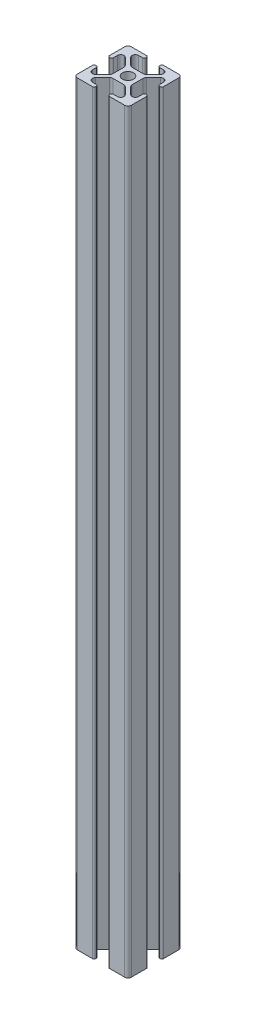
ISO-10303-21;
HEADER;
FILE_DESCRIPTION(('STEP AP214'),'2;1');
FILE_NAME('part.step','',(''),(''),'','','');
FILE_SCHEMA(('AUTOMOTIVE_DESIGN { 1 0 10303 214 1 1 1 1 }'));
ENDSEC;
DATA;
#1=APPLICATION_CONTEXT('core data for automotive mechanical design processes');
#2=APPLICATION_PROTOCOL_DEFINITION('international standard','automotive_design',2000,#1);
#3=PRODUCT_CONTEXT('',#1,'mechanical');
#4=PRODUCT('Part','Part','',(#3));
#5=PRODUCT_RELATED_PRODUCT_CATEGORY('part','',(#4));
#6=PRODUCT_DEFINITION_FORMATION('','',#4);
#7=PRODUCT_DEFINITION_CONTEXT('part definition',#1,'design');
#8=PRODUCT_DEFINITION('design','',#6,#7);
#9=PRODUCT_DEFINITION_SHAPE('','',#8);
#10=(LENGTH_UNIT() NAMED_UNIT(*) SI_UNIT(.MILLI.,.METRE.));
#11=(NAMED_UNIT(*) PLANE_ANGLE_UNIT() SI_UNIT($,.RADIAN.));
#12=(NAMED_UNIT(*) SI_UNIT($,.STERADIAN.) SOLID_ANGLE_UNIT());
#13=UNCERTAINTY_MEASURE_WITH_UNIT(LENGTH_MEASURE(1.E-05),#10,'distance_accuracy_value','');
#14=(GEOMETRIC_REPRESENTATION_CONTEXT(3) GLOBAL_UNCERTAINTY_ASSIGNED_CONTEXT((#13)) GLOBAL_UNIT_ASSIGNED_CONTEXT((#10,
#11,#12)) REPRESENTATION_CONTEXT('',''));
#15=CARTESIAN_POINT('',(0.,0.,0.));
#16=DIRECTION('',(0.,0.,1.));
#17=DIRECTION('',(1.,0.,0.));
#18=AXIS2_PLACEMENT_3D('',#15,#16,#17);
#19=CARTESIAN_POINT('',(3.34293596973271,355.602,18.542));
#20=DIRECTION('',(0.,1.,0.));
#21=DIRECTION('',(0.,0.,1.));
#22=AXIS2_PLACEMENT_3D('',#19,#20,#21);
#23=CYLINDRICAL_SURFACE('',#22,1.5875);
#24=CARTESIAN_POINT('',(3.34293596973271,355.6,18.542));
#25=DIRECTION('',(0.,-1.,0.));
#26=DIRECTION('',(0.,0.,-1.));
#27=AXIS2_PLACEMENT_3D('',#24,#25,#26);
#28=CIRCLE('',#27,1.5875);
#29=CARTESIAN_POINT('',(4.46546798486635,355.6,19.6645320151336));
#30=VERTEX_POINT('',#29);
#31=CARTESIAN_POINT('',(3.36324768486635,355.6,20.1293700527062));
#32=VERTEX_POINT('',#31);
#33=EDGE_CURVE('E988',#30,#32,#28,.T.);
#34=ORIENTED_EDGE('',*,*,#33,.F.);
#35=DIRECTION('',(0.,1.,0.));
#36=VECTOR('',#35,1.);
#37=CARTESIAN_POINT('',(4.46546798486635,355.6,19.6645320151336));
#38=LINE('',#37,#36);
#39=CARTESIAN_POINT('',(4.46546798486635,0.,19.6645320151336));
#40=VERTEX_POINT('',#39);
#41=EDGE_CURVE('E1473',#40,#30,#38,.T.);
#42=ORIENTED_EDGE('',*,*,#41,.F.);
#43=CARTESIAN_POINT('',(3.34293596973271,0.,18.542));
#44=DIRECTION('',(0.,1.,0.));
#45=DIRECTION('',(0.,0.,-1.));
#46=AXIS2_PLACEMENT_3D('',#43,#44,#45);
#47=CIRCLE('',#46,1.5875);
#48=CARTESIAN_POINT('',(3.36324768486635,0.,20.1293700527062));
#49=VERTEX_POINT('',#48);
#50=EDGE_CURVE('E1383',#49,#40,#47,.T.);
#51=ORIENTED_EDGE('',*,*,#50,.F.);
#52=DIRECTION('',(0.,1.,0.));
#53=VECTOR('',#52,1.);
#54=CARTESIAN_POINT('',(3.36324768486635,177.8,20.1293700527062));
#55=LINE('',#54,#53);
#56=EDGE_CURVE('E11',#49,#32,#55,.T.);
#57=ORIENTED_EDGE('',*,*,#56,.T.);
#58=EDGE_LOOP('',(#34,#42,#51,#57));
#59=FACE_BOUND('',#58,.T.);
#60=ADVANCED_FACE('F17',(#59),#23,.F.);
#61=CARTESIAN_POINT('',(3.38355939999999,355.602,18.542));
#62=DIRECTION('',(0.,1.,0.));
#63=DIRECTION('',(0.,0.,1.));
#64=AXIS2_PLACEMENT_3D('',#61,#62,#63);
#65=CYLINDRICAL_SURFACE('',#64,1.5875);
#66=DIRECTION('',(0.,-1.,0.));
#67=VECTOR('',#66,1.);
#68=CARTESIAN_POINT('',(1.79605939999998,0.,18.542));
#69=LINE('',#68,#67);
#70=CARTESIAN_POINT('',(1.79605939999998,355.6,18.542));
#71=VERTEX_POINT('',#70);
#72=CARTESIAN_POINT('',(1.79605939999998,0.,18.542));
#73=VERTEX_POINT('',#72);
#74=EDGE_CURVE('E1464',#71,#73,#69,.T.);
#75=ORIENTED_EDGE('',*,*,#74,.F.);
#76=CARTESIAN_POINT('',(3.38355939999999,355.6,18.542));
#77=DIRECTION('',(0.,-1.,0.));
#78=DIRECTION('',(0.,0.,-1.));
#79=AXIS2_PLACEMENT_3D('',#76,#77,#78);
#80=CIRCLE('',#79,1.5875);
#81=EDGE_CURVE('E1001',#32,#71,#80,.T.);
#82=ORIENTED_EDGE('',*,*,#81,.F.);
#83=ORIENTED_EDGE('',*,*,#56,.F.);
#84=CARTESIAN_POINT('',(3.38355939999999,0.,18.542));
#85=DIRECTION('',(0.,1.,0.));
#86=DIRECTION('',(0.,0.,-1.));
#87=AXIS2_PLACEMENT_3D('',#84,#85,#86);
#88=CIRCLE('',#87,1.5875);
#89=EDGE_CURVE('E1376',#73,#49,#88,.T.);
#90=ORIENTED_EDGE('',*,*,#89,.F.);
#91=EDGE_LOOP('',(#75,#82,#83,#90));
#92=FACE_BOUND('',#91,.T.);
#93=ADVANCED_FACE('F1848',(#92),#65,.F.);
#94=CARTESIAN_POINT('',(6.858,355.602,22.0164406));
#95=DIRECTION('',(0.,1.,0.));
#96=DIRECTION('',(0.,0.,1.));
#97=AXIS2_PLACEMENT_3D('',#94,#95,#96);
#98=CYLINDRICAL_SURFACE('',#97,1.5875);
#99=CARTESIAN_POINT('',(6.858,355.6,22.0164406));
#100=DIRECTION('',(0.,-1.,0.));
#101=DIRECTION('',(0.,0.,-1.));
#102=AXIS2_PLACEMENT_3D('',#99,#100,#101);
#103=CIRCLE('',#102,1.5875);
#104=CARTESIAN_POINT('',(6.858,355.6,23.6039406));
#105=VERTEX_POINT('',#104);
#106=CARTESIAN_POINT('',(5.27062994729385,355.6,22.0367523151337));
#107=VERTEX_POINT('',#106);
#108=EDGE_CURVE('E763',#105,#107,#103,.T.);
#109=ORIENTED_EDGE('',*,*,#108,.F.);
#110=DIRECTION('',(0.,1.,0.));
#111=VECTOR('',#110,1.);
#112=CARTESIAN_POINT('',(6.858,355.6,23.6039406));
#113=LINE('',#112,#111);
#114=CARTESIAN_POINT('',(6.858,0.,23.6039406));
#115=VERTEX_POINT('',#114);
#116=EDGE_CURVE('E1446',#115,#105,#113,.T.);
#117=ORIENTED_EDGE('',*,*,#116,.F.);
#118=CARTESIAN_POINT('',(6.858,0.,22.0164406));
#119=DIRECTION('',(0.,1.,0.));
#120=DIRECTION('',(0.,0.,-1.));
#121=AXIS2_PLACEMENT_3D('',#118,#119,#120);
#122=CIRCLE('',#121,1.5875);
#123=CARTESIAN_POINT('',(5.27062994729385,0.,22.0367523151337));
#124=VERTEX_POINT('',#123);
#125=EDGE_CURVE('E1217',#124,#115,#122,.T.);
#126=ORIENTED_EDGE('',*,*,#125,.F.);
#127=DIRECTION('',(0.,1.,0.));
#128=VECTOR('',#127,1.);
#129=CARTESIAN_POINT('',(5.27062994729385,177.8,22.0367523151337));
#130=LINE('',#129,#128);
#131=EDGE_CURVE('E26',#124,#107,#130,.T.);
#132=ORIENTED_EDGE('',*,*,#131,.T.);
#133=EDGE_LOOP('',(#109,#117,#126,#132));
#134=FACE_BOUND('',#133,.T.);
#135=ADVANCED_FACE('F1572',(#134),#98,.F.);
#136=CARTESIAN_POINT('',(6.858,355.602,22.0570640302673));
#137=DIRECTION('',(0.,1.,0.));
#138=DIRECTION('',(0.,0.,1.));
#139=AXIS2_PLACEMENT_3D('',#136,#137,#138);
#140=CYLINDRICAL_SURFACE('',#139,1.5875);
#141=DIRECTION('',(0.,-1.,0.));
#142=VECTOR('',#141,1.);
#143=CARTESIAN_POINT('',(5.73546798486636,0.,20.9345320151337));
#144=LINE('',#143,#142);
#145=CARTESIAN_POINT('',(5.73546798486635,355.6,20.9345320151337));
#146=VERTEX_POINT('',#145);
#147=CARTESIAN_POINT('',(5.73546798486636,0.,20.9345320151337));
#148=VERTEX_POINT('',#147);
#149=EDGE_CURVE('E1443',#146,#148,#144,.T.);
#150=ORIENTED_EDGE('',*,*,#149,.F.);
#151=CARTESIAN_POINT('',(6.858,355.6,22.0570640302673));
#152=DIRECTION('',(0.,-1.,0.));
#153=DIRECTION('',(0.,0.,-1.));
#154=AXIS2_PLACEMENT_3D('',#151,#152,#153);
#155=CIRCLE('',#154,1.5875);
#156=EDGE_CURVE('E941',#107,#146,#155,.T.);
#157=ORIENTED_EDGE('',*,*,#156,.F.);
#158=ORIENTED_EDGE('',*,*,#131,.F.);
#159=CARTESIAN_POINT('',(6.858,0.,22.0570640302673));
#160=DIRECTION('',(0.,1.,0.));
#161=DIRECTION('',(0.,0.,-1.));
#162=AXIS2_PLACEMENT_3D('',#159,#160,#161);
#163=CIRCLE('',#162,1.5875);
#164=EDGE_CURVE('E1222',#148,#124,#163,.T.);
#165=ORIENTED_EDGE('',*,*,#164,.F.);
#166=EDGE_LOOP('',(#150,#157,#158,#165));
#167=FACE_BOUND('',#166,.T.);
#168=ADVANCED_FACE('F1576',(#167),#140,.F.);
#169=CARTESIAN_POINT('',(6.604,355.602,15.2809359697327));
#170=DIRECTION('',(0.,1.,0.));
#171=DIRECTION('',(0.,0.,1.));
#172=AXIS2_PLACEMENT_3D('',#169,#170,#171);
#173=CYLINDRICAL_SURFACE('',#172,1.5875);
#174=CARTESIAN_POINT('',(6.604,355.6,15.2809359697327));
#175=DIRECTION('',(0.,-1.,0.));
#176=DIRECTION('',(0.,0.,-1.));
#177=AXIS2_PLACEMENT_3D('',#174,#175,#176);
#178=CIRCLE('',#177,1.5875);
#179=CARTESIAN_POINT('',(8.1915,355.6,15.2809359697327));
#180=VERTEX_POINT('',#179);
#181=CARTESIAN_POINT('',(7.72653201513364,355.6,16.4034679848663));
#182=VERTEX_POINT('',#181);
#183=EDGE_CURVE('E827',#180,#182,#178,.T.);
#184=ORIENTED_EDGE('',*,*,#183,.F.);
#185=DIRECTION('',(0.,1.,0.));
#186=VECTOR('',#185,1.);
#187=CARTESIAN_POINT('',(8.1915,355.6,15.2809359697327));
#188=LINE('',#187,#186);
#189=CARTESIAN_POINT('',(8.1915,0.,15.2809359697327));
#190=VERTEX_POINT('',#189);
#191=EDGE_CURVE('E1479',#190,#180,#188,.T.);
#192=ORIENTED_EDGE('',*,*,#191,.F.);
#193=CARTESIAN_POINT('',(6.604,0.,15.2809359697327));
#194=DIRECTION('',(0.,1.,0.));
#195=DIRECTION('',(0.,0.,-1.));
#196=AXIS2_PLACEMENT_3D('',#193,#194,#195);
#197=CIRCLE('',#196,1.5875);
#198=CARTESIAN_POINT('',(7.72653201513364,0.,16.4034679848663));
#199=VERTEX_POINT('',#198);
#200=EDGE_CURVE('E1391',#199,#190,#197,.T.);
#201=ORIENTED_EDGE('',*,*,#200,.F.);
#202=DIRECTION('',(0.,-1.,0.));
#203=VECTOR('',#202,1.);
#204=CARTESIAN_POINT('',(7.72653201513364,0.,16.4034679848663));
#205=LINE('',#204,#203);
#206=EDGE_CURVE('E1470',#182,#199,#205,.T.);
#207=ORIENTED_EDGE('',*,*,#206,.F.);
#208=EDGE_LOOP('',(#184,#192,#201,#207));
#209=FACE_BOUND('',#208,.T.);
#210=ADVANCED_FACE('F1837',(#209),#173,.F.);
#211=CARTESIAN_POINT('',(10.1190640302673,355.602,18.796));
#212=DIRECTION('',(0.,1.,0.));
#213=DIRECTION('',(0.,0.,1.));
#214=AXIS2_PLACEMENT_3D('',#211,#212,#213);
#215=CYLINDRICAL_SURFACE('',#214,1.5875);
#216=CARTESIAN_POINT('',(10.1190640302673,355.6,18.796));
#217=DIRECTION('',(0.,-1.,0.));
#218=DIRECTION('',(0.,0.,-1.));
#219=AXIS2_PLACEMENT_3D('',#216,#217,#218);
#220=CIRCLE('',#219,1.5875);
#221=CARTESIAN_POINT('',(8.99653201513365,355.6,17.6734679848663));
#222=VERTEX_POINT('',#221);
#223=CARTESIAN_POINT('',(10.1190640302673,355.6,17.2085));
#224=VERTEX_POINT('',#223);
#225=EDGE_CURVE('E1038',#222,#224,#220,.T.);
#226=ORIENTED_EDGE('',*,*,#225,.F.);
#227=DIRECTION('',(0.,1.,0.));
#228=VECTOR('',#227,1.);
#229=CARTESIAN_POINT('',(8.99653201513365,355.6,17.6734679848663));
#230=LINE('',#229,#228);
#231=CARTESIAN_POINT('',(8.99653201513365,0.,17.6734679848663));
#232=VERTEX_POINT('',#231);
#233=EDGE_CURVE('E1440',#232,#222,#230,.T.);
#234=ORIENTED_EDGE('',*,*,#233,.F.);
#235=CARTESIAN_POINT('',(10.1190640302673,0.,18.796));
#236=DIRECTION('',(0.,1.,0.));
#237=DIRECTION('',(0.,0.,-1.));
#238=AXIS2_PLACEMENT_3D('',#235,#236,#237);
#239=CIRCLE('',#238,1.5875);
#240=CARTESIAN_POINT('',(10.1190640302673,0.,17.2085));
#241=VERTEX_POINT('',#240);
#242=EDGE_CURVE('E1337',#241,#232,#239,.T.);
#243=ORIENTED_EDGE('',*,*,#242,.F.);
#244=DIRECTION('',(0.,-1.,0.));
#245=VECTOR('',#244,1.);
#246=CARTESIAN_POINT('',(10.1190640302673,0.,17.2085));
#247=LINE('',#246,#245);
#248=EDGE_CURVE('E1437',#224,#241,#247,.T.);
#249=ORIENTED_EDGE('',*,*,#248,.F.);
#250=EDGE_LOOP('',(#226,#234,#243,#249));
#251=FACE_BOUND('',#250,.T.);
#252=ADVANCED_FACE('F1596',(#251),#215,.F.);
#253=CARTESIAN_POINT('',(15.2809359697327,355.602,18.796));
#254=DIRECTION('',(0.,1.,0.));
#255=DIRECTION('',(0.,0.,1.));
#256=AXIS2_PLACEMENT_3D('',#253,#254,#255);
#257=CYLINDRICAL_SURFACE('',#256,1.5875);
#258=CARTESIAN_POINT('',(15.2809359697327,355.6,18.796));
#259=DIRECTION('',(0.,-1.,0.));
#260=DIRECTION('',(0.,0.,-1.));
#261=AXIS2_PLACEMENT_3D('',#258,#259,#260);
#262=CIRCLE('',#261,1.5875);
#263=CARTESIAN_POINT('',(15.2809359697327,355.6,17.2085));
#264=VERTEX_POINT('',#263);
#265=CARTESIAN_POINT('',(16.4034679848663,355.6,17.6734679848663));
#266=VERTEX_POINT('',#265);
#267=EDGE_CURVE('E850',#264,#266,#262,.T.);
#268=ORIENTED_EDGE('',*,*,#267,.F.);
#269=DIRECTION('',(0.,1.,0.));
#270=VECTOR('',#269,1.);
#271=CARTESIAN_POINT('',(15.2809359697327,355.6,17.2085));
#272=LINE('',#271,#270);
#273=CARTESIAN_POINT('',(15.2809359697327,0.,17.2085));
#274=VERTEX_POINT('',#273);
#275=EDGE_CURVE('E1434',#274,#264,#272,.T.);
#276=ORIENTED_EDGE('',*,*,#275,.F.);
#277=CARTESIAN_POINT('',(15.2809359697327,0.,18.796));
#278=DIRECTION('',(0.,1.,0.));
#279=DIRECTION('',(0.,0.,-1.));
#280=AXIS2_PLACEMENT_3D('',#277,#278,#279);
#281=CIRCLE('',#280,1.5875);
#282=CARTESIAN_POINT('',(16.4034679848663,0.,17.6734679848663));
#283=VERTEX_POINT('',#282);
#284=EDGE_CURVE('E1329',#283,#274,#281,.T.);
#285=ORIENTED_EDGE('',*,*,#284,.F.);
#286=DIRECTION('',(0.,-1.,0.));
#287=VECTOR('',#286,1.);
#288=CARTESIAN_POINT('',(16.4034679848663,0.,17.6734679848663));
#289=LINE('',#288,#287);
#290=EDGE_CURVE('E1431',#266,#283,#289,.T.);
#291=ORIENTED_EDGE('',*,*,#290,.F.);
#292=EDGE_LOOP('',(#268,#276,#285,#291));
#293=FACE_BOUND('',#292,.T.);
#294=ADVANCED_FACE('F1602',(#293),#257,.F.);
#295=CARTESIAN_POINT('',(18.542,355.602,22.0164406));
#296=DIRECTION('',(0.,1.,0.));
#297=DIRECTION('',(0.,0.,1.));
#298=AXIS2_PLACEMENT_3D('',#295,#296,#297);
#299=CYLINDRICAL_SURFACE('',#298,1.5875);
#300=CARTESIAN_POINT('',(18.542,355.6,22.0164406));
#301=DIRECTION('',(0.,-1.,0.));
#302=DIRECTION('',(0.,0.,-1.));
#303=AXIS2_PLACEMENT_3D('',#300,#301,#302);
#304=CIRCLE('',#303,1.5875);
#305=CARTESIAN_POINT('',(20.1293700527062,355.6,22.0367523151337));
#306=VERTEX_POINT('',#305);
#307=CARTESIAN_POINT('',(18.542,355.6,23.6039406));
#308=VERTEX_POINT('',#307);
#309=EDGE_CURVE('E799',#306,#308,#304,.T.);
#310=ORIENTED_EDGE('',*,*,#309,.F.);
#311=DIRECTION('',(0.,-1.,0.));
#312=VECTOR('',#311,1.);
#313=CARTESIAN_POINT('',(20.1293700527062,177.8,22.0367523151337));
#314=LINE('',#313,#312);
#315=CARTESIAN_POINT('',(20.1293700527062,0.,22.0367523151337));
#316=VERTEX_POINT('',#315);
#317=EDGE_CURVE('E1564',#306,#316,#314,.T.);
#318=ORIENTED_EDGE('',*,*,#317,.T.);
#319=CARTESIAN_POINT('',(18.542,0.,22.0164406));
#320=DIRECTION('',(0.,1.,0.));
#321=DIRECTION('',(0.,0.,-1.));
#322=AXIS2_PLACEMENT_3D('',#319,#320,#321);
#323=CIRCLE('',#322,1.5875);
#324=CARTESIAN_POINT('',(18.542,0.,23.6039406));
#325=VERTEX_POINT('',#324);
#326=EDGE_CURVE('E928',#325,#316,#323,.T.);
#327=ORIENTED_EDGE('',*,*,#326,.F.);
#328=DIRECTION('',(0.,-1.,0.));
#329=VECTOR('',#328,1.);
#330=CARTESIAN_POINT('',(18.542,0.,23.6039406));
#331=LINE('',#330,#329);
#332=EDGE_CURVE('E1028',#308,#325,#331,.T.);
#333=ORIENTED_EDGE('',*,*,#332,.F.);
#334=EDGE_LOOP('',(#310,#318,#327,#333));
#335=FACE_BOUND('',#334,.T.);
#336=ADVANCED_FACE('F19',(#335),#299,.F.);
#337=CARTESIAN_POINT('',(18.542,355.602,22.0570640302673));
#338=DIRECTION('',(0.,1.,0.));
#339=DIRECTION('',(0.,0.,1.));
#340=AXIS2_PLACEMENT_3D('',#337,#338,#339);
#341=CYLINDRICAL_SURFACE('',#340,1.5875);
#342=ORIENTED_EDGE('',*,*,#317,.F.);
#343=CARTESIAN_POINT('',(18.542,355.6,22.0570640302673));
#344=DIRECTION('',(0.,-1.,0.));
#345=DIRECTION('',(0.,0.,-1.));
#346=AXIS2_PLACEMENT_3D('',#343,#344,#345);
#347=CIRCLE('',#346,1.5875);
#348=CARTESIAN_POINT('',(19.6645320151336,355.6,20.9345320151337));
#349=VERTEX_POINT('',#348);
#350=EDGE_CURVE('E795',#349,#306,#347,.T.);
#351=ORIENTED_EDGE('',*,*,#350,.F.);
#352=DIRECTION('',(0.,1.,0.));
#353=VECTOR('',#352,1.);
#354=CARTESIAN_POINT('',(19.6645320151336,355.6,20.9345320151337));
#355=LINE('',#354,#353);
#356=CARTESIAN_POINT('',(19.6645320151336,0.,20.9345320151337));
#357=VERTEX_POINT('',#356);
#358=EDGE_CURVE('E1428',#357,#349,#355,.T.);
#359=ORIENTED_EDGE('',*,*,#358,.F.);
#360=CARTESIAN_POINT('',(18.542,0.,22.0570640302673));
#361=DIRECTION('',(0.,1.,0.));
#362=DIRECTION('',(0.,0.,-1.));
#363=AXIS2_PLACEMENT_3D('',#360,#361,#362);
#364=CIRCLE('',#363,1.5875);
#365=EDGE_CURVE('E923',#316,#357,#364,.T.);
#366=ORIENTED_EDGE('',*,*,#365,.F.);
#367=EDGE_LOOP('',(#342,#351,#359,#366));
#368=FACE_BOUND('',#367,.T.);
#369=ADVANCED_FACE('F1610',(#368),#341,.F.);
#370=CARTESIAN_POINT('',(18.796,355.602,15.2809359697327));
#371=DIRECTION('',(0.,1.,0.));
#372=DIRECTION('',(0.,0.,1.));
#373=AXIS2_PLACEMENT_3D('',#370,#371,#372);
#374=CYLINDRICAL_SURFACE('',#373,1.5875);
#375=CARTESIAN_POINT('',(18.796,355.6,15.2809359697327));
#376=DIRECTION('',(0.,-1.,0.));
#377=DIRECTION('',(0.,0.,-1.));
#378=AXIS2_PLACEMENT_3D('',#375,#376,#377);
#379=CIRCLE('',#378,1.5875);
#380=CARTESIAN_POINT('',(17.6734679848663,355.6,16.4034679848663));
#381=VERTEX_POINT('',#380);
#382=CARTESIAN_POINT('',(17.2085,355.6,15.2809359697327));
#383=VERTEX_POINT('',#382);
#384=EDGE_CURVE('E874',#381,#383,#379,.T.);
#385=ORIENTED_EDGE('',*,*,#384,.F.);
#386=DIRECTION('',(0.,1.,0.));
#387=VECTOR('',#386,1.);
#388=CARTESIAN_POINT('',(17.6734679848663,355.6,16.4034679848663));
#389=LINE('',#388,#387);
#390=CARTESIAN_POINT('',(17.6734679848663,0.,16.4034679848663));
#391=VERTEX_POINT('',#390);
#392=EDGE_CURVE('E878',#391,#381,#389,.T.);
#393=ORIENTED_EDGE('',*,*,#392,.F.);
#394=CARTESIAN_POINT('',(18.796,0.,15.2809359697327));
#395=DIRECTION('',(0.,1.,0.));
#396=DIRECTION('',(0.,0.,-1.));
#397=AXIS2_PLACEMENT_3D('',#394,#395,#396);
#398=CIRCLE('',#397,1.5875);
#399=CARTESIAN_POINT('',(17.2085,0.,15.2809359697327));
#400=VERTEX_POINT('',#399);
#401=EDGE_CURVE('E1269',#400,#391,#398,.T.);
#402=ORIENTED_EDGE('',*,*,#401,.F.);
#403=DIRECTION('',(0.,-1.,0.));
#404=VECTOR('',#403,1.);
#405=CARTESIAN_POINT('',(17.2085,0.,15.2809359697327));
#406=LINE('',#405,#404);
#407=EDGE_CURVE('E1511',#383,#400,#406,.T.);
#408=ORIENTED_EDGE('',*,*,#407,.F.);
#409=EDGE_LOOP('',(#385,#393,#402,#408));
#410=FACE_BOUND('',#409,.T.);
#411=ADVANCED_FACE('F1785',(#410),#374,.F.);
#412=CARTESIAN_POINT('',(22.0164406,355.602,18.542));
#413=DIRECTION('',(0.,1.,0.));
#414=DIRECTION('',(0.,0.,1.));
#415=AXIS2_PLACEMENT_3D('',#412,#413,#414);
#416=CYLINDRICAL_SURFACE('',#415,1.5875);
#417=CARTESIAN_POINT('',(22.0164406,355.6,18.542));
#418=DIRECTION('',(0.,-1.,0.));
#419=DIRECTION('',(0.,0.,-1.));
#420=AXIS2_PLACEMENT_3D('',#417,#418,#419);
#421=CIRCLE('',#420,1.5875);
#422=CARTESIAN_POINT('',(23.6039406,355.6,18.542));
#423=VERTEX_POINT('',#422);
#424=CARTESIAN_POINT('',(22.0367523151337,355.6,20.1293700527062));
#425=VERTEX_POINT('',#424);
#426=EDGE_CURVE('E983',#423,#425,#421,.T.);
#427=ORIENTED_EDGE('',*,*,#426,.F.);
#428=DIRECTION('',(0.,1.,0.));
#429=VECTOR('',#428,1.);
#430=CARTESIAN_POINT('',(23.6039406,355.6,18.542));
#431=LINE('',#430,#429);
#432=CARTESIAN_POINT('',(23.6039406,0.,18.542));
#433=VERTEX_POINT('',#432);
#434=EDGE_CURVE('E881',#433,#423,#431,.T.);
#435=ORIENTED_EDGE('',*,*,#434,.F.);
#436=CARTESIAN_POINT('',(22.0164406,0.,18.542));
#437=DIRECTION('',(0.,1.,0.));
#438=DIRECTION('',(0.,0.,-1.));
#439=AXIS2_PLACEMENT_3D('',#436,#437,#438);
#440=CIRCLE('',#439,1.5875);
#441=CARTESIAN_POINT('',(22.0367523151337,0.,20.1293700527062));
#442=VERTEX_POINT('',#441);
#443=EDGE_CURVE('E1281',#442,#433,#440,.T.);
#444=ORIENTED_EDGE('',*,*,#443,.F.);
#445=DIRECTION('',(0.,1.,0.));
#446=VECTOR('',#445,1.);
#447=CARTESIAN_POINT('',(22.0367523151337,177.8,20.1293700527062));
#448=LINE('',#447,#446);
#449=EDGE_CURVE('E1561',#442,#425,#448,.T.);
#450=ORIENTED_EDGE('',*,*,#449,.T.);
#451=EDGE_LOOP('',(#427,#435,#444,#450));
#452=FACE_BOUND('',#451,.T.);
#453=ADVANCED_FACE('F1797',(#452),#416,.F.);
#454=CARTESIAN_POINT('',(22.0570640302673,355.602,18.542));
#455=DIRECTION('',(0.,1.,0.));
#456=DIRECTION('',(0.,0.,1.));
#457=AXIS2_PLACEMENT_3D('',#454,#455,#456);
#458=CYLINDRICAL_SURFACE('',#457,1.5875);
#459=DIRECTION('',(0.,-1.,0.));
#460=VECTOR('',#459,1.);
#461=CARTESIAN_POINT('',(20.9345320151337,0.,19.6645320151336));
#462=LINE('',#461,#460);
#463=CARTESIAN_POINT('',(20.9345320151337,355.6,19.6645320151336));
#464=VERTEX_POINT('',#463);
#465=CARTESIAN_POINT('',(20.9345320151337,0.,19.6645320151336));
#466=VERTEX_POINT('',#465);
#467=EDGE_CURVE('E882',#464,#466,#462,.T.);
#468=ORIENTED_EDGE('',*,*,#467,.F.);
#469=CARTESIAN_POINT('',(22.0570640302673,355.6,18.542));
#470=DIRECTION('',(0.,-1.,0.));
#471=DIRECTION('',(0.,0.,-1.));
#472=AXIS2_PLACEMENT_3D('',#469,#470,#471);
#473=CIRCLE('',#472,1.5875);
#474=EDGE_CURVE('E875',#425,#464,#473,.T.);
#475=ORIENTED_EDGE('',*,*,#474,.F.);
#476=ORIENTED_EDGE('',*,*,#449,.F.);
#477=CARTESIAN_POINT('',(22.0570640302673,0.,18.542));
#478=DIRECTION('',(0.,1.,0.));
#479=DIRECTION('',(0.,0.,-1.));
#480=AXIS2_PLACEMENT_3D('',#477,#478,#479);
#481=CIRCLE('',#480,1.5875);
#482=EDGE_CURVE('E1277',#466,#442,#481,.T.);
#483=ORIENTED_EDGE('',*,*,#482,.F.);
#484=EDGE_LOOP('',(#468,#475,#476,#483));
#485=FACE_BOUND('',#484,.T.);
#486=ADVANCED_FACE('F1792',(#485),#458,.F.);
#487=CARTESIAN_POINT('',(18.796,355.602,10.1190640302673));
#488=DIRECTION('',(0.,1.,0.));
#489=DIRECTION('',(0.,0.,1.));
#490=AXIS2_PLACEMENT_3D('',#487,#488,#489);
#491=CYLINDRICAL_SURFACE('',#490,1.5875);
#492=CARTESIAN_POINT('',(18.796,355.6,10.1190640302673));
#493=DIRECTION('',(0.,-1.,0.));
#494=DIRECTION('',(0.,0.,-1.));
#495=AXIS2_PLACEMENT_3D('',#492,#493,#494);
#496=CIRCLE('',#495,1.5875);
#497=CARTESIAN_POINT('',(17.2085,355.6,10.1190640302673));
#498=VERTEX_POINT('',#497);
#499=CARTESIAN_POINT('',(17.6734679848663,355.6,8.99653201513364));
#500=VERTEX_POINT('',#499);
#501=EDGE_CURVE('E965',#498,#500,#496,.T.);
#502=ORIENTED_EDGE('',*,*,#501,.F.);
#503=DIRECTION('',(0.,1.,0.));
#504=VECTOR('',#503,1.);
#505=CARTESIAN_POINT('',(17.2085,355.6,10.1190640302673));
#506=LINE('',#505,#504);
#507=CARTESIAN_POINT('',(17.2085,0.,10.1190640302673));
#508=VERTEX_POINT('',#507);
#509=EDGE_CURVE('E1508',#508,#498,#506,.T.);
#510=ORIENTED_EDGE('',*,*,#509,.F.);
#511=CARTESIAN_POINT('',(18.796,0.,10.1190640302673));
#512=DIRECTION('',(0.,1.,0.));
#513=DIRECTION('',(0.,0.,-1.));
#514=AXIS2_PLACEMENT_3D('',#511,#512,#513);
#515=CIRCLE('',#514,1.5875);
#516=CARTESIAN_POINT('',(17.6734679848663,0.,8.99653201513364));
#517=VERTEX_POINT('',#516);
#518=EDGE_CURVE('E1261',#517,#508,#515,.T.);
#519=ORIENTED_EDGE('',*,*,#518,.F.);
#520=DIRECTION('',(0.,-1.,0.));
#521=VECTOR('',#520,1.);
#522=CARTESIAN_POINT('',(17.6734679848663,0.,8.99653201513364));
#523=LINE('',#522,#521);
#524=EDGE_CURVE('E1505',#500,#517,#523,.T.);
#525=ORIENTED_EDGE('',*,*,#524,.F.);
#526=EDGE_LOOP('',(#502,#510,#519,#525));
#527=FACE_BOUND('',#526,.T.);
#528=ADVANCED_FACE('F1777',(#527),#491,.F.);
#529=CARTESIAN_POINT('',(22.0164406,355.602,6.858));
#530=DIRECTION('',(0.,1.,0.));
#531=DIRECTION('',(0.,0.,1.));
#532=AXIS2_PLACEMENT_3D('',#529,#530,#531);
#533=CYLINDRICAL_SURFACE('',#532,1.5875);
#534=CARTESIAN_POINT('',(22.0164406,355.6,6.858));
#535=DIRECTION('',(0.,-1.,0.));
#536=DIRECTION('',(0.,0.,-1.));
#537=AXIS2_PLACEMENT_3D('',#534,#535,#536);
#538=CIRCLE('',#537,1.5875);
#539=CARTESIAN_POINT('',(22.0367523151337,355.6,5.27062994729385));
#540=VERTEX_POINT('',#539);
#541=CARTESIAN_POINT('',(23.6039406,355.6,6.858));
#542=VERTEX_POINT('',#541);
#543=EDGE_CURVE('E1116',#540,#542,#538,.T.);
#544=ORIENTED_EDGE('',*,*,#543,.F.);
#545=DIRECTION('',(0.,-1.,0.));
#546=VECTOR('',#545,1.);
#547=CARTESIAN_POINT('',(22.0367523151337,177.8,5.27062994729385));
#548=LINE('',#547,#546);
#549=CARTESIAN_POINT('',(22.0367523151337,0.,5.27062994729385));
#550=VERTEX_POINT('',#549);
#551=EDGE_CURVE('E1558',#540,#550,#548,.T.);
#552=ORIENTED_EDGE('',*,*,#551,.T.);
#553=CARTESIAN_POINT('',(22.0164406,0.,6.858));
#554=DIRECTION('',(0.,1.,0.));
#555=DIRECTION('',(0.,0.,-1.));
#556=AXIS2_PLACEMENT_3D('',#553,#554,#555);
#557=CIRCLE('',#556,1.5875);
#558=CARTESIAN_POINT('',(23.6039406,0.,6.858));
#559=VERTEX_POINT('',#558);
#560=EDGE_CURVE('E1213',#559,#550,#557,.T.);
#561=ORIENTED_EDGE('',*,*,#560,.F.);
#562=DIRECTION('',(0.,-1.,0.));
#563=VECTOR('',#562,1.);
#564=CARTESIAN_POINT('',(23.6039406,0.,6.858));
#565=LINE('',#564,#563);
#566=EDGE_CURVE('E1053',#542,#559,#565,.T.);
#567=ORIENTED_EDGE('',*,*,#566,.F.);
#568=EDGE_LOOP('',(#544,#552,#561,#567));
#569=FACE_BOUND('',#568,.T.);
#570=ADVANCED_FACE('F1764',(#569),#533,.F.);
#571=CARTESIAN_POINT('',(22.0570640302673,355.602,6.858));
#572=DIRECTION('',(0.,1.,0.));
#573=DIRECTION('',(0.,0.,1.));
#574=AXIS2_PLACEMENT_3D('',#571,#572,#573);
#575=CYLINDRICAL_SURFACE('',#574,1.5875);
#576=ORIENTED_EDGE('',*,*,#551,.F.);
#577=CARTESIAN_POINT('',(22.0570640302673,355.6,6.858));
#578=DIRECTION('',(0.,-1.,0.));
#579=DIRECTION('',(0.,0.,-1.));
#580=AXIS2_PLACEMENT_3D('',#577,#578,#579);
#581=CIRCLE('',#580,1.5875);
#582=CARTESIAN_POINT('',(20.9345320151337,355.6,5.73546798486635));
#583=VERTEX_POINT('',#582);
#584=EDGE_CURVE('E1112',#583,#540,#581,.T.);
#585=ORIENTED_EDGE('',*,*,#584,.F.);
#586=DIRECTION('',(0.,1.,0.));
#587=VECTOR('',#586,1.);
#588=CARTESIAN_POINT('',(20.9345320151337,355.6,5.73546798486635));
#589=LINE('',#588,#587);
#590=CARTESIAN_POINT('',(20.9345320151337,0.,5.73546798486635));
#591=VERTEX_POINT('',#590);
#592=EDGE_CURVE('E726',#591,#583,#589,.T.);
#593=ORIENTED_EDGE('',*,*,#592,.F.);
#594=CARTESIAN_POINT('',(22.0570640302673,0.,6.858));
#595=DIRECTION('',(0.,1.,0.));
#596=DIRECTION('',(0.,0.,-1.));
#597=AXIS2_PLACEMENT_3D('',#594,#595,#596);
#598=CIRCLE('',#597,1.5875);
#599=EDGE_CURVE('E1253',#550,#591,#598,.T.);
#600=ORIENTED_EDGE('',*,*,#599,.F.);
#601=EDGE_LOOP('',(#576,#585,#593,#600));
#602=FACE_BOUND('',#601,.T.);
#603=ADVANCED_FACE('F1768',(#602),#575,.F.);
#604=CARTESIAN_POINT('',(18.542,355.602,3.34293596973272));
#605=DIRECTION('',(0.,1.,0.));
#606=DIRECTION('',(0.,0.,1.));
#607=AXIS2_PLACEMENT_3D('',#604,#605,#606);
#608=CYLINDRICAL_SURFACE('',#607,1.5875);
#609=CARTESIAN_POINT('',(18.542,355.6,3.34293596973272));
#610=DIRECTION('',(0.,-1.,0.));
#611=DIRECTION('',(0.,0.,-1.));
#612=AXIS2_PLACEMENT_3D('',#609,#610,#611);
#613=CIRCLE('',#612,1.5875);
#614=CARTESIAN_POINT('',(20.1293700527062,355.6,3.36324768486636));
#615=VERTEX_POINT('',#614);
#616=CARTESIAN_POINT('',(19.6645320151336,355.6,4.46546798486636));
#617=VERTEX_POINT('',#616);
#618=EDGE_CURVE('E902',#615,#617,#613,.T.);
#619=ORIENTED_EDGE('',*,*,#618,.F.);
#620=DIRECTION('',(0.,-1.,0.));
#621=VECTOR('',#620,1.);
#622=CARTESIAN_POINT('',(20.1293700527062,177.8,3.36324768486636));
#623=LINE('',#622,#621);
#624=CARTESIAN_POINT('',(20.1293700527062,0.,3.36324768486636));
#625=VERTEX_POINT('',#624);
#626=EDGE_CURVE('E1555',#615,#625,#623,.T.);
#627=ORIENTED_EDGE('',*,*,#626,.T.);
#628=CARTESIAN_POINT('',(18.542,0.,3.34293596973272));
#629=DIRECTION('',(0.,1.,0.));
#630=DIRECTION('',(0.,0.,-1.));
#631=AXIS2_PLACEMENT_3D('',#628,#629,#630);
#632=CIRCLE('',#631,1.5875);
#633=CARTESIAN_POINT('',(19.6645320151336,0.,4.46546798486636));
#634=VERTEX_POINT('',#633);
#635=EDGE_CURVE('E773',#634,#625,#632,.T.);
#636=ORIENTED_EDGE('',*,*,#635,.F.);
#637=DIRECTION('',(0.,-1.,0.));
#638=VECTOR('',#637,1.);
#639=CARTESIAN_POINT('',(19.6645320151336,0.,4.46546798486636));
#640=LINE('',#639,#638);
#641=EDGE_CURVE('E1534',#617,#634,#640,.T.);
#642=ORIENTED_EDGE('',*,*,#641,.F.);
#643=EDGE_LOOP('',(#619,#627,#636,#642));
#644=FACE_BOUND('',#643,.T.);
#645=ADVANCED_FACE('F1714',(#644),#608,.F.);
#646=CARTESIAN_POINT('',(18.542,355.602,3.3835594));
#647=DIRECTION('',(0.,1.,0.));
#648=DIRECTION('',(0.,0.,1.));
#649=AXIS2_PLACEMENT_3D('',#646,#647,#648);
#650=CYLINDRICAL_SURFACE('',#649,1.5875);
#651=ORIENTED_EDGE('',*,*,#626,.F.);
#652=CARTESIAN_POINT('',(18.542,355.6,3.3835594));
#653=DIRECTION('',(0.,-1.,0.));
#654=DIRECTION('',(0.,0.,-1.));
#655=AXIS2_PLACEMENT_3D('',#652,#653,#654);
#656=CIRCLE('',#655,1.5875);
#657=CARTESIAN_POINT('',(18.542,355.6,1.7960594));
#658=VERTEX_POINT('',#657);
#659=EDGE_CURVE('E898',#658,#615,#656,.T.);
#660=ORIENTED_EDGE('',*,*,#659,.F.);
#661=DIRECTION('',(0.,1.,0.));
#662=VECTOR('',#661,1.);
#663=CARTESIAN_POINT('',(18.542,355.6,1.7960594));
#664=LINE('',#663,#662);
#665=CARTESIAN_POINT('',(18.542,0.,1.7960594));
#666=VERTEX_POINT('',#665);
#667=EDGE_CURVE('E1537',#666,#658,#664,.T.);
#668=ORIENTED_EDGE('',*,*,#667,.F.);
#669=CARTESIAN_POINT('',(18.542,0.,3.3835594));
#670=DIRECTION('',(0.,1.,0.));
#671=DIRECTION('',(0.,0.,-1.));
#672=AXIS2_PLACEMENT_3D('',#669,#670,#671);
#673=CIRCLE('',#672,1.5875);
#674=EDGE_CURVE('E769',#625,#666,#673,.T.);
#675=ORIENTED_EDGE('',*,*,#674,.F.);
#676=EDGE_LOOP('',(#651,#660,#668,#675));
#677=FACE_BOUND('',#676,.T.);
#678=ADVANCED_FACE('F1717',(#677),#650,.F.);
#679=CARTESIAN_POINT('',(15.2809359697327,355.602,6.604));
#680=DIRECTION('',(0.,1.,0.));
#681=DIRECTION('',(0.,0.,1.));
#682=AXIS2_PLACEMENT_3D('',#679,#680,#681);
#683=CYLINDRICAL_SURFACE('',#682,1.5875);
#684=CARTESIAN_POINT('',(15.2809359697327,355.6,6.604));
#685=DIRECTION('',(0.,-1.,0.));
#686=DIRECTION('',(0.,0.,-1.));
#687=AXIS2_PLACEMENT_3D('',#684,#685,#686);
#688=CIRCLE('',#687,1.5875);
#689=CARTESIAN_POINT('',(16.4034679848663,355.6,7.72653201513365));
#690=VERTEX_POINT('',#689);
#691=CARTESIAN_POINT('',(15.2809359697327,355.6,8.1915));
#692=VERTEX_POINT('',#691);
#693=EDGE_CURVE('E745',#690,#692,#688,.T.);
#694=ORIENTED_EDGE('',*,*,#693,.F.);
#695=DIRECTION('',(0.,1.,0.));
#696=VECTOR('',#695,1.);
#697=CARTESIAN_POINT('',(16.4034679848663,355.6,7.72653201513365));
#698=LINE('',#697,#696);
#699=CARTESIAN_POINT('',(16.4034679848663,0.,7.72653201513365));
#700=VERTEX_POINT('',#699);
#701=EDGE_CURVE('E1182',#700,#690,#698,.T.);
#702=ORIENTED_EDGE('',*,*,#701,.F.);
#703=CARTESIAN_POINT('',(15.2809359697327,0.,6.604));
#704=DIRECTION('',(0.,1.,0.));
#705=DIRECTION('',(0.,0.,-1.));
#706=AXIS2_PLACEMENT_3D('',#703,#704,#705);
#707=CIRCLE('',#706,1.5875);
#708=CARTESIAN_POINT('',(15.2809359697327,0.,8.1915));
#709=VERTEX_POINT('',#708);
#710=EDGE_CURVE('E1014',#709,#700,#707,.T.);
#711=ORIENTED_EDGE('',*,*,#710,.F.);
#712=DIRECTION('',(0.,-1.,0.));
#713=VECTOR('',#712,1.);
#714=CARTESIAN_POINT('',(15.2809359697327,0.,8.1915));
#715=LINE('',#714,#713);
#716=EDGE_CURVE('E1179',#692,#709,#715,.T.);
#717=ORIENTED_EDGE('',*,*,#716,.F.);
#718=EDGE_LOOP('',(#694,#702,#711,#717));
#719=FACE_BOUND('',#718,.T.);
#720=ADVANCED_FACE('F1705',(#719),#683,.F.);
#721=CARTESIAN_POINT('',(10.1190640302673,355.602,6.604));
#722=DIRECTION('',(0.,1.,0.));
#723=DIRECTION('',(0.,0.,1.));
#724=AXIS2_PLACEMENT_3D('',#721,#722,#723);
#725=CYLINDRICAL_SURFACE('',#724,1.5875);
#726=CARTESIAN_POINT('',(10.1190640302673,355.6,6.604));
#727=DIRECTION('',(0.,-1.,0.));
#728=DIRECTION('',(0.,0.,-1.));
#729=AXIS2_PLACEMENT_3D('',#726,#727,#728);
#730=CIRCLE('',#729,1.5875);
#731=CARTESIAN_POINT('',(10.1190640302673,355.6,8.1915));
#732=VERTEX_POINT('',#731);
#733=CARTESIAN_POINT('',(8.99653201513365,355.6,7.72653201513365));
#734=VERTEX_POINT('',#733);
#735=EDGE_CURVE('E1083',#732,#734,#730,.T.);
#736=ORIENTED_EDGE('',*,*,#735,.F.);
#737=DIRECTION('',(0.,1.,0.));
#738=VECTOR('',#737,1.);
#739=CARTESIAN_POINT('',(10.1190640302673,355.6,8.1915));
#740=LINE('',#739,#738);
#741=CARTESIAN_POINT('',(10.1190640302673,0.,8.1915));
#742=VERTEX_POINT('',#741);
#743=EDGE_CURVE('E1183',#742,#732,#740,.T.);
#744=ORIENTED_EDGE('',*,*,#743,.F.);
#745=CARTESIAN_POINT('',(10.1190640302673,0.,6.604));
#746=DIRECTION('',(0.,1.,0.));
#747=DIRECTION('',(0.,0.,-1.));
#748=AXIS2_PLACEMENT_3D('',#745,#746,#747);
#749=CIRCLE('',#748,1.5875);
#750=CARTESIAN_POINT('',(8.99653201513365,0.,7.72653201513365));
#751=VERTEX_POINT('',#750);
#752=EDGE_CURVE('E1015',#751,#742,#749,.T.);
#753=ORIENTED_EDGE('',*,*,#752,.F.);
#754=DIRECTION('',(0.,-1.,0.));
#755=VECTOR('',#754,1.);
#756=CARTESIAN_POINT('',(8.99653201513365,0.,7.72653201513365));
#757=LINE('',#756,#755);
#758=EDGE_CURVE('E743',#734,#751,#757,.T.);
#759=ORIENTED_EDGE('',*,*,#758,.F.);
#760=EDGE_LOOP('',(#736,#744,#753,#759));
#761=FACE_BOUND('',#760,.T.);
#762=ADVANCED_FACE('F1696',(#761),#725,.F.);
#763=CARTESIAN_POINT('',(6.858,355.602,3.38355939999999));
#764=DIRECTION('',(0.,1.,0.));
#765=DIRECTION('',(0.,0.,1.));
#766=AXIS2_PLACEMENT_3D('',#763,#764,#765);
#767=CYLINDRICAL_SURFACE('',#766,1.5875);
#768=CARTESIAN_POINT('',(6.858,355.6,3.38355939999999));
#769=DIRECTION('',(0.,-1.,0.));
#770=DIRECTION('',(0.,0.,-1.));
#771=AXIS2_PLACEMENT_3D('',#768,#769,#770);
#772=CIRCLE('',#771,1.5875);
#773=CARTESIAN_POINT('',(5.27062994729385,355.6,3.36324768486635));
#774=VERTEX_POINT('',#773);
#775=CARTESIAN_POINT('',(6.858,355.6,1.79605939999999));
#776=VERTEX_POINT('',#775);
#777=EDGE_CURVE('E1163',#774,#776,#772,.T.);
#778=ORIENTED_EDGE('',*,*,#777,.F.);
#779=DIRECTION('',(0.,-1.,0.));
#780=VECTOR('',#779,1.);
#781=CARTESIAN_POINT('',(5.27062994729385,177.8,3.36324768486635));
#782=LINE('',#781,#780);
#783=CARTESIAN_POINT('',(5.27062994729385,0.,3.36324768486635));
#784=VERTEX_POINT('',#783);
#785=EDGE_CURVE('E1552',#774,#784,#782,.T.);
#786=ORIENTED_EDGE('',*,*,#785,.T.);
#787=CARTESIAN_POINT('',(6.858,0.,3.38355939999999));
#788=DIRECTION('',(0.,1.,0.));
#789=DIRECTION('',(0.,0.,-1.));
#790=AXIS2_PLACEMENT_3D('',#787,#788,#789);
#791=CIRCLE('',#790,1.5875);
#792=CARTESIAN_POINT('',(6.858,0.,1.79605939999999));
#793=VERTEX_POINT('',#792);
#794=EDGE_CURVE('E1229',#793,#784,#791,.T.);
#795=ORIENTED_EDGE('',*,*,#794,.F.);
#796=DIRECTION('',(0.,-1.,0.));
#797=VECTOR('',#796,1.);
#798=CARTESIAN_POINT('',(6.858,0.,1.79605939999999));
#799=LINE('',#798,#797);
#800=EDGE_CURVE('E906',#776,#793,#799,.T.);
#801=ORIENTED_EDGE('',*,*,#800,.F.);
#802=EDGE_LOOP('',(#778,#786,#795,#801));
#803=FACE_BOUND('',#802,.T.);
#804=ADVANCED_FACE('F1684',(#803),#767,.F.);
#805=CARTESIAN_POINT('',(6.858,355.602,3.34293596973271));
#806=DIRECTION('',(0.,1.,0.));
#807=DIRECTION('',(0.,0.,1.));
#808=AXIS2_PLACEMENT_3D('',#805,#806,#807);
#809=CYLINDRICAL_SURFACE('',#808,1.5875);
#810=ORIENTED_EDGE('',*,*,#785,.F.);
#811=CARTESIAN_POINT('',(6.858,355.6,3.34293596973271));
#812=DIRECTION('',(0.,-1.,0.));
#813=DIRECTION('',(0.,0.,-1.));
#814=AXIS2_PLACEMENT_3D('',#811,#812,#813);
#815=CIRCLE('',#814,1.5875);
#816=CARTESIAN_POINT('',(5.73546798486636,355.6,4.46546798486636));
#817=VERTEX_POINT('',#816);
#818=EDGE_CURVE('E1167',#817,#774,#815,.T.);
#819=ORIENTED_EDGE('',*,*,#818,.F.);
#820=DIRECTION('',(0.,1.,0.));
#821=VECTOR('',#820,1.);
#822=CARTESIAN_POINT('',(5.73546798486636,355.6,4.46546798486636));
#823=LINE('',#822,#821);
#824=CARTESIAN_POINT('',(5.73546798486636,0.,4.46546798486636));
#825=VERTEX_POINT('',#824);
#826=EDGE_CURVE('E740',#825,#817,#823,.T.);
#827=ORIENTED_EDGE('',*,*,#826,.F.);
#828=CARTESIAN_POINT('',(6.858,0.,3.34293596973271));
#829=DIRECTION('',(0.,1.,0.));
#830=DIRECTION('',(0.,0.,-1.));
#831=AXIS2_PLACEMENT_3D('',#828,#829,#830);
#832=CIRCLE('',#831,1.5875);
#833=EDGE_CURVE('E1136',#784,#825,#832,.T.);
#834=ORIENTED_EDGE('',*,*,#833,.F.);
#835=EDGE_LOOP('',(#810,#819,#827,#834));
#836=FACE_BOUND('',#835,.T.);
#837=ADVANCED_FACE('F1688',(#836),#809,.F.);
#838=CARTESIAN_POINT('',(3.34293596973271,355.602,6.858));
#839=DIRECTION('',(0.,1.,0.));
#840=DIRECTION('',(0.,0.,1.));
#841=AXIS2_PLACEMENT_3D('',#838,#839,#840);
#842=CYLINDRICAL_SURFACE('',#841,1.5875);
#843=CARTESIAN_POINT('',(3.34293596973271,355.6,6.858));
#844=DIRECTION('',(0.,-1.,0.));
#845=DIRECTION('',(0.,0.,-1.));
#846=AXIS2_PLACEMENT_3D('',#843,#844,#845);
#847=CIRCLE('',#846,1.5875);
#848=CARTESIAN_POINT('',(3.36324768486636,355.6,5.27062994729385));
#849=VERTEX_POINT('',#848);
#850=CARTESIAN_POINT('',(4.46546798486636,355.6,5.73546798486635));
#851=VERTEX_POINT('',#850);
#852=EDGE_CURVE('E949',#849,#851,#847,.T.);
#853=ORIENTED_EDGE('',*,*,#852,.F.);
#854=DIRECTION('',(0.,-1.,0.));
#855=VECTOR('',#854,1.);
#856=CARTESIAN_POINT('',(3.36324768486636,177.8,5.27062994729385));
#857=LINE('',#856,#855);
#858=CARTESIAN_POINT('',(3.36324768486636,0.,5.27062994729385));
#859=VERTEX_POINT('',#858);
#860=EDGE_CURVE('E1549',#849,#859,#857,.T.);
#861=ORIENTED_EDGE('',*,*,#860,.T.);
#862=CARTESIAN_POINT('',(3.34293596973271,0.,6.858));
#863=DIRECTION('',(0.,1.,0.));
#864=DIRECTION('',(0.,0.,-1.));
#865=AXIS2_PLACEMENT_3D('',#862,#863,#864);
#866=CIRCLE('',#865,1.5875);
#867=CARTESIAN_POINT('',(4.46546798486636,0.,5.73546798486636));
#868=VERTEX_POINT('',#867);
#869=EDGE_CURVE('E1407',#868,#859,#866,.T.);
#870=ORIENTED_EDGE('',*,*,#869,.F.);
#871=DIRECTION('',(0.,-1.,0.));
#872=VECTOR('',#871,1.);
#873=CARTESIAN_POINT('',(4.46546798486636,0.,5.73546798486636));
#874=LINE('',#873,#872);
#875=EDGE_CURVE('E1485',#851,#868,#874,.T.);
#876=ORIENTED_EDGE('',*,*,#875,.F.);
#877=EDGE_LOOP('',(#853,#861,#870,#876));
#878=FACE_BOUND('',#877,.T.);
#879=ADVANCED_FACE('F1820',(#878),#842,.F.);
#880=CARTESIAN_POINT('',(3.3835594,355.602,6.858));
#881=DIRECTION('',(0.,1.,0.));
#882=DIRECTION('',(0.,0.,1.));
#883=AXIS2_PLACEMENT_3D('',#880,#881,#882);
#884=CYLINDRICAL_SURFACE('',#883,1.5875);
#885=ORIENTED_EDGE('',*,*,#860,.F.);
#886=CARTESIAN_POINT('',(3.3835594,355.6,6.858));
#887=DIRECTION('',(0.,-1.,0.));
#888=DIRECTION('',(0.,0.,-1.));
#889=AXIS2_PLACEMENT_3D('',#886,#887,#888);
#890=CIRCLE('',#889,1.5875);
#891=CARTESIAN_POINT('',(1.7960594,355.6,6.858));
#892=VERTEX_POINT('',#891);
#893=EDGE_CURVE('E945',#892,#849,#890,.T.);
#894=ORIENTED_EDGE('',*,*,#893,.F.);
#895=DIRECTION('',(0.,1.,0.));
#896=VECTOR('',#895,1.);
#897=CARTESIAN_POINT('',(1.7960594,355.6,6.858));
#898=LINE('',#897,#896);
#899=CARTESIAN_POINT('',(1.7960594,0.,6.858));
#900=VERTEX_POINT('',#899);
#901=EDGE_CURVE('E1488',#900,#892,#898,.T.);
#902=ORIENTED_EDGE('',*,*,#901,.F.);
#903=CARTESIAN_POINT('',(3.3835594,0.,6.858));
#904=DIRECTION('',(0.,1.,0.));
#905=DIRECTION('',(0.,0.,-1.));
#906=AXIS2_PLACEMENT_3D('',#903,#904,#905);
#907=CIRCLE('',#906,1.5875);
#908=EDGE_CURVE('E869',#859,#900,#907,.T.);
#909=ORIENTED_EDGE('',*,*,#908,.F.);
#910=EDGE_LOOP('',(#885,#894,#902,#909));
#911=FACE_BOUND('',#910,.T.);
#912=ADVANCED_FACE('F1816',(#911),#884,.F.);
#913=CARTESIAN_POINT('',(6.604,355.602,10.1190640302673));
#914=DIRECTION('',(0.,1.,0.));
#915=DIRECTION('',(0.,0.,1.));
#916=AXIS2_PLACEMENT_3D('',#913,#914,#915);
#917=CYLINDRICAL_SURFACE('',#916,1.5875);
#918=CARTESIAN_POINT('',(6.604,355.6,10.1190640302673));
#919=DIRECTION('',(0.,-1.,0.));
#920=DIRECTION('',(0.,0.,-1.));
#921=AXIS2_PLACEMENT_3D('',#918,#919,#920);
#922=CIRCLE('',#921,1.5875);
#923=CARTESIAN_POINT('',(7.72653201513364,355.6,8.99653201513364));
#924=VERTEX_POINT('',#923);
#925=CARTESIAN_POINT('',(8.1915,355.6,10.1190640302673));
#926=VERTEX_POINT('',#925);
#927=EDGE_CURVE('E828',#924,#926,#922,.T.);
#928=ORIENTED_EDGE('',*,*,#927,.F.);
#929=DIRECTION('',(0.,1.,0.));
#930=VECTOR('',#929,1.);
#931=CARTESIAN_POINT('',(7.72653201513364,355.6,8.99653201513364));
#932=LINE('',#931,#930);
#933=CARTESIAN_POINT('',(7.72653201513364,0.,8.99653201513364));
#934=VERTEX_POINT('',#933);
#935=EDGE_CURVE('E1482',#934,#924,#932,.T.);
#936=ORIENTED_EDGE('',*,*,#935,.F.);
#937=CARTESIAN_POINT('',(6.604,0.,10.1190640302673));
#938=DIRECTION('',(0.,1.,0.));
#939=DIRECTION('',(0.,0.,-1.));
#940=AXIS2_PLACEMENT_3D('',#937,#938,#939);
#941=CIRCLE('',#940,1.5875);
#942=CARTESIAN_POINT('',(8.1915,0.,10.1190640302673));
#943=VERTEX_POINT('',#942);
#944=EDGE_CURVE('E1399',#943,#934,#941,.T.);
#945=ORIENTED_EDGE('',*,*,#944,.F.);
#946=DIRECTION('',(0.,-1.,0.));
#947=VECTOR('',#946,1.);
#948=CARTESIAN_POINT('',(8.1915,0.,10.1190640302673));
#949=LINE('',#948,#947);
#950=EDGE_CURVE('E1476',#926,#943,#949,.T.);
#951=ORIENTED_EDGE('',*,*,#950,.F.);
#952=EDGE_LOOP('',(#928,#936,#945,#951));
#953=FACE_BOUND('',#952,.T.);
#954=ADVANCED_FACE('F1828',(#953),#917,.F.);
#955=CARTESIAN_POINT('',(0.79375,355.6,16.73225));
#956=DIRECTION('',(0.,-1.,0.));
#957=DIRECTION('',(0.,0.,-1.));
#958=AXIS2_PLACEMENT_3D('',#955,#956,#957);
#959=CYLINDRICAL_SURFACE('',#958,0.79375);
#960=CARTESIAN_POINT('',(0.79375,355.6,16.73225));
#961=DIRECTION('',(0.,1.,0.));
#962=DIRECTION('',(0.,0.,-1.));
#963=AXIS2_PLACEMENT_3D('',#960,#961,#962);
#964=CIRCLE('',#963,0.79375);
#965=CARTESIAN_POINT('',(0.79375,355.6,15.9385));
#966=VERTEX_POINT('',#965);
#967=CARTESIAN_POINT('',(0.,355.6,16.73225));
#968=VERTEX_POINT('',#967);
#969=EDGE_CURVE('E1023',#966,#968,#964,.T.);
#970=ORIENTED_EDGE('',*,*,#969,.F.);
#971=DIRECTION('',(0.,1.,0.));
#972=VECTOR('',#971,1.);
#973=CARTESIAN_POINT('',(0.79375,355.602,15.9385));
#974=LINE('',#973,#972);
#975=CARTESIAN_POINT('',(0.79375,0.,15.9385));
#976=VERTEX_POINT('',#975);
#977=EDGE_CURVE('E1461',#976,#966,#974,.T.);
#978=ORIENTED_EDGE('',*,*,#977,.F.);
#979=CARTESIAN_POINT('',(0.79375,0.,16.73225));
#980=DIRECTION('',(0.,-1.,0.));
#981=DIRECTION('',(0.,0.,-1.));
#982=AXIS2_PLACEMENT_3D('',#979,#980,#981);
#983=CIRCLE('',#982,0.79375);
#984=CARTESIAN_POINT('',(0.,0.,16.73225));
#985=VERTEX_POINT('',#984);
#986=EDGE_CURVE('E792',#985,#976,#983,.T.);
#987=ORIENTED_EDGE('',*,*,#986,.F.);
#988=DIRECTION('',(0.,-1.,0.));
#989=VECTOR('',#988,1.);
#990=CARTESIAN_POINT('',(0.,355.6,16.73225));
#991=LINE('',#990,#989);
#992=EDGE_CURVE('E840',#968,#985,#991,.T.);
#993=ORIENTED_EDGE('',*,*,#992,.F.);
#994=EDGE_LOOP('',(#970,#978,#987,#993));
#995=FACE_BOUND('',#994,.T.);
#996=ADVANCED_FACE('F1862',(#995),#959,.T.);
#997=CARTESIAN_POINT('',(1.00230939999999,355.602,16.73225));
#998=DIRECTION('',(0.,-1.,0.));
#999=DIRECTION('',(0.,0.,-1.));
#1000=AXIS2_PLACEMENT_3D('',#997,#998,#999);
#1001=CYLINDRICAL_SURFACE('',#1000,0.79375);
#1002=CARTESIAN_POINT('',(1.00230939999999,355.6,16.73225));
#1003=DIRECTION('',(0.,1.,0.));
#1004=DIRECTION('',(0.,0.,-1.));
#1005=AXIS2_PLACEMENT_3D('',#1002,#1003,#1004);
#1006=CIRCLE('',#1005,0.79375);
#1007=CARTESIAN_POINT('',(1.79605939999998,355.6,16.73225));
#1008=VERTEX_POINT('',#1007);
#1009=CARTESIAN_POINT('',(1.00230939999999,355.6,15.9385));
#1010=VERTEX_POINT('',#1009);
#1011=EDGE_CURVE('E1009',#1008,#1010,#1006,.T.);
#1012=ORIENTED_EDGE('',*,*,#1011,.F.);
#1013=DIRECTION('',(0.,1.,0.));
#1014=VECTOR('',#1013,1.);
#1015=CARTESIAN_POINT('',(1.79605939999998,355.602,16.73225));
#1016=LINE('',#1015,#1014);
#1017=CARTESIAN_POINT('',(1.79605939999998,0.,16.73225));
#1018=VERTEX_POINT('',#1017);
#1019=EDGE_CURVE('E1467',#1018,#1008,#1016,.T.);
#1020=ORIENTED_EDGE('',*,*,#1019,.F.);
#1021=CARTESIAN_POINT('',(1.00230939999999,0.,16.73225));
#1022=DIRECTION('',(0.,-1.,0.));
#1023=DIRECTION('',(0.,0.,-1.));
#1024=AXIS2_PLACEMENT_3D('',#1021,#1022,#1023);
#1025=CIRCLE('',#1024,0.79375);
#1026=CARTESIAN_POINT('',(1.00230939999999,0.,15.9385));
#1027=VERTEX_POINT('',#1026);
#1028=EDGE_CURVE('E1368',#1027,#1018,#1025,.T.);
#1029=ORIENTED_EDGE('',*,*,#1028,.F.);
#1030=DIRECTION('',(0.,-1.,0.));
#1031=VECTOR('',#1030,1.);
#1032=CARTESIAN_POINT('',(1.00230939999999,355.602,15.9385));
#1033=LINE('',#1032,#1031);
#1034=EDGE_CURVE('E1458',#1010,#1027,#1033,.T.);
#1035=ORIENTED_EDGE('',*,*,#1034,.F.);
#1036=EDGE_LOOP('',(#1012,#1020,#1029,#1035));
#1037=FACE_BOUND('',#1036,.T.);
#1038=ADVANCED_FACE('F1855',(#1037),#1001,.T.);
#1039=CARTESIAN_POINT('',(8.66775,355.602,24.60625));
#1040=DIRECTION('',(0.,-1.,0.));
#1041=DIRECTION('',(0.,0.,-1.));
#1042=AXIS2_PLACEMENT_3D('',#1039,#1040,#1041);
#1043=CYLINDRICAL_SURFACE('',#1042,0.79375);
#1044=CARTESIAN_POINT('',(8.66775,355.6,24.60625));
#1045=DIRECTION('',(0.,1.,0.));
#1046=DIRECTION('',(0.,0.,-1.));
#1047=AXIS2_PLACEMENT_3D('',#1044,#1045,#1046);
#1048=CIRCLE('',#1047,0.79375);
#1049=CARTESIAN_POINT('',(8.66775,355.6,25.4));
#1050=VERTEX_POINT('',#1049);
#1051=CARTESIAN_POINT('',(9.4615,355.6,24.60625));
#1052=VERTEX_POINT('',#1051);
#1053=EDGE_CURVE('E774',#1050,#1052,#1048,.T.);
#1054=ORIENTED_EDGE('',*,*,#1053,.F.);
#1055=DIRECTION('',(0.,1.,0.));
#1056=VECTOR('',#1055,1.);
#1057=CARTESIAN_POINT('',(8.66775,355.6,25.4));
#1058=LINE('',#1057,#1056);
#1059=CARTESIAN_POINT('',(8.66775,0.,25.4));
#1060=VERTEX_POINT('',#1059);
#1061=EDGE_CURVE('E734',#1060,#1050,#1058,.T.);
#1062=ORIENTED_EDGE('',*,*,#1061,.F.);
#1063=CARTESIAN_POINT('',(8.66775,0.,24.60625));
#1064=DIRECTION('',(0.,-1.,0.));
#1065=DIRECTION('',(0.,0.,-1.));
#1066=AXIS2_PLACEMENT_3D('',#1063,#1064,#1065);
#1067=CIRCLE('',#1066,0.79375);
#1068=CARTESIAN_POINT('',(9.4615,0.,24.60625));
#1069=VERTEX_POINT('',#1068);
#1070=EDGE_CURVE('E793',#1069,#1060,#1067,.T.);
#1071=ORIENTED_EDGE('',*,*,#1070,.F.);
#1072=DIRECTION('',(0.,-1.,0.));
#1073=VECTOR('',#1072,1.);
#1074=CARTESIAN_POINT('',(9.4615,355.602,24.60625));
#1075=LINE('',#1074,#1073);
#1076=EDGE_CURVE('E1455',#1052,#1069,#1075,.T.);
#1077=ORIENTED_EDGE('',*,*,#1076,.F.);
#1078=EDGE_LOOP('',(#1054,#1062,#1071,#1077));
#1079=FACE_BOUND('',#1078,.T.);
#1080=ADVANCED_FACE('F1878',(#1079),#1043,.T.);
#1081=CARTESIAN_POINT('',(8.66775,355.602,24.3976906));
#1082=DIRECTION('',(0.,-1.,0.));
#1083=DIRECTION('',(0.,0.,-1.));
#1084=AXIS2_PLACEMENT_3D('',#1081,#1082,#1083);
#1085=CYLINDRICAL_SURFACE('',#1084,0.79375);
#1086=CARTESIAN_POINT('',(8.66775,355.6,24.3976906));
#1087=DIRECTION('',(0.,1.,0.));
#1088=DIRECTION('',(0.,0.,-1.));
#1089=AXIS2_PLACEMENT_3D('',#1086,#1087,#1088);
#1090=CIRCLE('',#1089,0.79375);
#1091=CARTESIAN_POINT('',(9.4615,355.6,24.3976906));
#1092=VERTEX_POINT('',#1091);
#1093=CARTESIAN_POINT('',(8.66775,355.6,23.6039406));
#1094=VERTEX_POINT('',#1093);
#1095=EDGE_CURVE('E764',#1092,#1094,#1090,.T.);
#1096=ORIENTED_EDGE('',*,*,#1095,.F.);
#1097=DIRECTION('',(0.,1.,0.));
#1098=VECTOR('',#1097,1.);
#1099=CARTESIAN_POINT('',(9.4615,355.602,24.3976906));
#1100=LINE('',#1099,#1098);
#1101=CARTESIAN_POINT('',(9.4615,0.,24.3976906));
#1102=VERTEX_POINT('',#1101);
#1103=EDGE_CURVE('E1452',#1102,#1092,#1100,.T.);
#1104=ORIENTED_EDGE('',*,*,#1103,.F.);
#1105=CARTESIAN_POINT('',(8.66775,0.,24.3976906));
#1106=DIRECTION('',(0.,-1.,0.));
#1107=DIRECTION('',(0.,0.,-1.));
#1108=AXIS2_PLACEMENT_3D('',#1105,#1106,#1107);
#1109=CIRCLE('',#1108,0.79375);
#1110=CARTESIAN_POINT('',(8.66775,0.,23.6039406));
#1111=VERTEX_POINT('',#1110);
#1112=EDGE_CURVE('E1351',#1111,#1102,#1109,.T.);
#1113=ORIENTED_EDGE('',*,*,#1112,.F.);
#1114=DIRECTION('',(0.,-1.,0.));
#1115=VECTOR('',#1114,1.);
#1116=CARTESIAN_POINT('',(8.66775,355.602,23.6039406));
#1117=LINE('',#1116,#1115);
#1118=EDGE_CURVE('E1449',#1094,#1111,#1117,.T.);
#1119=ORIENTED_EDGE('',*,*,#1118,.F.);
#1120=EDGE_LOOP('',(#1096,#1104,#1113,#1119));
#1121=FACE_BOUND('',#1120,.T.);
#1122=ADVANCED_FACE('F1884',(#1121),#1085,.T.);
#1123=CARTESIAN_POINT('',(16.73225,355.6,24.60625));
#1124=DIRECTION('',(0.,-1.,0.));
#1125=DIRECTION('',(0.,0.,-1.));
#1126=AXIS2_PLACEMENT_3D('',#1123,#1124,#1125);
#1127=CYLINDRICAL_SURFACE('',#1126,0.79375);
#1128=CARTESIAN_POINT('',(16.73225,355.6,24.60625));
#1129=DIRECTION('',(0.,1.,0.));
#1130=DIRECTION('',(0.,0.,-1.));
#1131=AXIS2_PLACEMENT_3D('',#1128,#1129,#1130);
#1132=CIRCLE('',#1131,0.79375);
#1133=CARTESIAN_POINT('',(15.9385,355.6,24.60625));
#1134=VERTEX_POINT('',#1133);
#1135=CARTESIAN_POINT('',(16.73225,355.6,25.4));
#1136=VERTEX_POINT('',#1135);
#1137=EDGE_CURVE('E915',#1134,#1136,#1132,.T.);
#1138=ORIENTED_EDGE('',*,*,#1137,.F.);
#1139=DIRECTION('',(0.,1.,0.));
#1140=VECTOR('',#1139,1.);
#1141=CARTESIAN_POINT('',(15.9385,355.602,24.60625));
#1142=LINE('',#1141,#1140);
#1143=CARTESIAN_POINT('',(15.9385,0.,24.60625));
#1144=VERTEX_POINT('',#1143);
#1145=EDGE_CURVE('E1032',#1144,#1134,#1142,.T.);
#1146=ORIENTED_EDGE('',*,*,#1145,.F.);
#1147=CARTESIAN_POINT('',(16.73225,0.,24.60625));
#1148=DIRECTION('',(0.,-1.,0.));
#1149=DIRECTION('',(0.,0.,-1.));
#1150=AXIS2_PLACEMENT_3D('',#1147,#1148,#1149);
#1151=CIRCLE('',#1150,0.79375);
#1152=CARTESIAN_POINT('',(16.73225,0.,25.4));
#1153=VERTEX_POINT('',#1152);
#1154=EDGE_CURVE('E1303',#1153,#1144,#1151,.T.);
#1155=ORIENTED_EDGE('',*,*,#1154,.F.);
#1156=DIRECTION('',(0.,-1.,0.));
#1157=VECTOR('',#1156,1.);
#1158=CARTESIAN_POINT('',(16.73225,355.6,25.4));
#1159=LINE('',#1158,#1157);
#1160=EDGE_CURVE('E887',#1136,#1153,#1159,.T.);
#1161=ORIENTED_EDGE('',*,*,#1160,.F.);
#1162=EDGE_LOOP('',(#1138,#1146,#1155,#1161));
#1163=FACE_BOUND('',#1162,.T.);
#1164=ADVANCED_FACE('F1629',(#1163),#1127,.T.);
#1165=CARTESIAN_POINT('',(16.73225,355.602,24.3976906));
#1166=DIRECTION('',(0.,-1.,0.));
#1167=DIRECTION('',(0.,0.,-1.));
#1168=AXIS2_PLACEMENT_3D('',#1165,#1166,#1167);
#1169=CYLINDRICAL_SURFACE('',#1168,0.79375);
#1170=CARTESIAN_POINT('',(16.73225,355.6,24.3976906));
#1171=DIRECTION('',(0.,1.,0.));
#1172=DIRECTION('',(0.,0.,-1.));
#1173=AXIS2_PLACEMENT_3D('',#1170,#1171,#1172);
#1174=CIRCLE('',#1173,0.79375);
#1175=CARTESIAN_POINT('',(16.73225,355.6,23.6039406));
#1176=VERTEX_POINT('',#1175);
#1177=CARTESIAN_POINT('',(15.9385,355.6,24.3976906));
#1178=VERTEX_POINT('',#1177);
#1179=EDGE_CURVE('E997',#1176,#1178,#1174,.T.);
#1180=ORIENTED_EDGE('',*,*,#1179,.F.);
#1181=DIRECTION('',(0.,1.,0.));
#1182=VECTOR('',#1181,1.);
#1183=CARTESIAN_POINT('',(16.73225,355.602,23.6039406));
#1184=LINE('',#1183,#1182);
#1185=CARTESIAN_POINT('',(16.73225,0.,23.6039406));
#1186=VERTEX_POINT('',#1185);
#1187=EDGE_CURVE('E1031',#1186,#1176,#1184,.T.);
#1188=ORIENTED_EDGE('',*,*,#1187,.F.);
#1189=CARTESIAN_POINT('',(16.73225,0.,24.3976906));
#1190=DIRECTION('',(0.,-1.,0.));
#1191=DIRECTION('',(0.,0.,-1.));
#1192=AXIS2_PLACEMENT_3D('',#1189,#1190,#1191);
#1193=CIRCLE('',#1192,0.79375);
#1194=CARTESIAN_POINT('',(15.9385,0.,24.3976906));
#1195=VERTEX_POINT('',#1194);
#1196=EDGE_CURVE('E1315',#1195,#1186,#1193,.T.);
#1197=ORIENTED_EDGE('',*,*,#1196,.F.);
#1198=DIRECTION('',(0.,-1.,0.));
#1199=VECTOR('',#1198,1.);
#1200=CARTESIAN_POINT('',(15.9385,355.602,24.3976906));
#1201=LINE('',#1200,#1199);
#1202=EDGE_CURVE('E701',#1178,#1195,#1201,.T.);
#1203=ORIENTED_EDGE('',*,*,#1202,.F.);
#1204=EDGE_LOOP('',(#1180,#1188,#1197,#1203));
#1205=FACE_BOUND('',#1204,.T.);
#1206=ADVANCED_FACE('F1622',(#1205),#1169,.T.);
#1207=CARTESIAN_POINT('',(24.3976906,355.602,16.73225));
#1208=DIRECTION('',(0.,-1.,0.));
#1209=DIRECTION('',(0.,0.,-1.));
#1210=AXIS2_PLACEMENT_3D('',#1207,#1208,#1209);
#1211=CYLINDRICAL_SURFACE('',#1210,0.79375);
#1212=CARTESIAN_POINT('',(24.3976906,355.6,16.73225));
#1213=DIRECTION('',(0.,1.,0.));
#1214=DIRECTION('',(0.,0.,-1.));
#1215=AXIS2_PLACEMENT_3D('',#1212,#1213,#1214);
#1216=CIRCLE('',#1215,0.79375);
#1217=CARTESIAN_POINT('',(24.3976906,355.6,15.9385));
#1218=VERTEX_POINT('',#1217);
#1219=CARTESIAN_POINT('',(23.6039406,355.6,16.73225));
#1220=VERTEX_POINT('',#1219);
#1221=EDGE_CURVE('E984',#1218,#1220,#1216,.T.);
#1222=ORIENTED_EDGE('',*,*,#1221,.F.);
#1223=DIRECTION('',(0.,1.,0.));
#1224=VECTOR('',#1223,1.);
#1225=CARTESIAN_POINT('',(24.3976906,355.602,15.9385));
#1226=LINE('',#1225,#1224);
#1227=CARTESIAN_POINT('',(24.3976906,0.,15.9385));
#1228=VERTEX_POINT('',#1227);
#1229=EDGE_CURVE('E1521',#1228,#1218,#1226,.T.);
#1230=ORIENTED_EDGE('',*,*,#1229,.F.);
#1231=CARTESIAN_POINT('',(24.3976906,0.,16.73225));
#1232=DIRECTION('',(0.,-1.,0.));
#1233=DIRECTION('',(0.,0.,-1.));
#1234=AXIS2_PLACEMENT_3D('',#1231,#1232,#1233);
#1235=CIRCLE('',#1234,0.79375);
#1236=CARTESIAN_POINT('',(23.6039406,0.,16.73225));
#1237=VERTEX_POINT('',#1236);
#1238=EDGE_CURVE('E1289',#1237,#1228,#1235,.T.);
#1239=ORIENTED_EDGE('',*,*,#1238,.F.);
#1240=DIRECTION('',(0.,-1.,0.));
#1241=VECTOR('',#1240,1.);
#1242=CARTESIAN_POINT('',(23.6039406,355.602,16.73225));
#1243=LINE('',#1242,#1241);
#1244=EDGE_CURVE('E1379',#1220,#1237,#1243,.T.);
#1245=ORIENTED_EDGE('',*,*,#1244,.F.);
#1246=EDGE_LOOP('',(#1222,#1230,#1239,#1245));
#1247=FACE_BOUND('',#1246,.T.);
#1248=ADVANCED_FACE('F1803',(#1247),#1211,.T.);
#1249=CARTESIAN_POINT('',(24.60625,355.602,16.73225));
#1250=DIRECTION('',(0.,1.,0.));
#1251=DIRECTION('',(0.,0.,1.));
#1252=AXIS2_PLACEMENT_3D('',#1249,#1250,#1251);
#1253=CYLINDRICAL_SURFACE('',#1252,0.79375);
#1254=CARTESIAN_POINT('',(24.60625,355.6,16.73225));
#1255=DIRECTION('',(0.,1.,0.));
#1256=DIRECTION('',(0.,0.,-1.));
#1257=AXIS2_PLACEMENT_3D('',#1254,#1255,#1256);
#1258=CIRCLE('',#1257,0.79375);
#1259=CARTESIAN_POINT('',(25.4,355.6,16.73225));
#1260=VERTEX_POINT('',#1259);
#1261=CARTESIAN_POINT('',(24.60625,355.6,15.9385));
#1262=VERTEX_POINT('',#1261);
#1263=EDGE_CURVE('E1091',#1260,#1262,#1258,.T.);
#1264=ORIENTED_EDGE('',*,*,#1263,.F.);
#1265=DIRECTION('',(0.,1.,0.));
#1266=VECTOR('',#1265,1.);
#1267=CARTESIAN_POINT('',(25.4,355.6,16.73225));
#1268=LINE('',#1267,#1266);
#1269=CARTESIAN_POINT('',(25.4,0.,16.73225));
#1270=VERTEX_POINT('',#1269);
#1271=EDGE_CURVE('E888',#1270,#1260,#1268,.T.);
#1272=ORIENTED_EDGE('',*,*,#1271,.F.);
#1273=CARTESIAN_POINT('',(24.60625,0.,16.73225));
#1274=DIRECTION('',(0.,-1.,0.));
#1275=DIRECTION('',(0.,0.,-1.));
#1276=AXIS2_PLACEMENT_3D('',#1273,#1274,#1275);
#1277=CIRCLE('',#1276,0.79375);
#1278=CARTESIAN_POINT('',(24.60625,0.,15.9385));
#1279=VERTEX_POINT('',#1278);
#1280=EDGE_CURVE('E1297',#1279,#1270,#1277,.T.);
#1281=ORIENTED_EDGE('',*,*,#1280,.F.);
#1282=DIRECTION('',(0.,-1.,0.));
#1283=VECTOR('',#1282,1.);
#1284=CARTESIAN_POINT('',(24.60625,0.,15.9385));
#1285=LINE('',#1284,#1283);
#1286=EDGE_CURVE('E1518',#1262,#1279,#1285,.T.);
#1287=ORIENTED_EDGE('',*,*,#1286,.F.);
#1288=EDGE_LOOP('',(#1264,#1272,#1281,#1287));
#1289=FACE_BOUND('',#1288,.T.);
#1290=ADVANCED_FACE('F1646',(#1289),#1253,.T.);
#1291=CARTESIAN_POINT('',(24.60625,355.6,8.66775));
#1292=DIRECTION('',(0.,1.,0.));
#1293=DIRECTION('',(0.,0.,1.));
#1294=AXIS2_PLACEMENT_3D('',#1291,#1292,#1293);
#1295=CYLINDRICAL_SURFACE('',#1294,0.79375);
#1296=CARTESIAN_POINT('',(24.60625,355.6,8.66775));
#1297=DIRECTION('',(0.,1.,0.));
#1298=DIRECTION('',(0.,0.,-1.));
#1299=AXIS2_PLACEMENT_3D('',#1296,#1297,#1298);
#1300=CIRCLE('',#1299,0.79375);
#1301=CARTESIAN_POINT('',(24.60625,355.6,9.4615));
#1302=VERTEX_POINT('',#1301);
#1303=CARTESIAN_POINT('',(25.4,355.6,8.66775));
#1304=VERTEX_POINT('',#1303);
#1305=EDGE_CURVE('E757',#1302,#1304,#1300,.T.);
#1306=ORIENTED_EDGE('',*,*,#1305,.F.);
#1307=DIRECTION('',(0.,1.,0.));
#1308=VECTOR('',#1307,1.);
#1309=CARTESIAN_POINT('',(24.60625,355.6,9.4615));
#1310=LINE('',#1309,#1308);
#1311=CARTESIAN_POINT('',(24.60625,0.,9.4615));
#1312=VERTEX_POINT('',#1311);
#1313=EDGE_CURVE('E1057',#1312,#1302,#1310,.T.);
#1314=ORIENTED_EDGE('',*,*,#1313,.F.);
#1315=CARTESIAN_POINT('',(24.60625,0.,8.66775));
#1316=DIRECTION('',(0.,-1.,0.));
#1317=DIRECTION('',(0.,0.,-1.));
#1318=AXIS2_PLACEMENT_3D('',#1315,#1316,#1317);
#1319=CIRCLE('',#1318,0.79375);
#1320=CARTESIAN_POINT('',(25.4,0.,8.66775));
#1321=VERTEX_POINT('',#1320);
#1322=EDGE_CURVE('E789',#1321,#1312,#1319,.T.);
#1323=ORIENTED_EDGE('',*,*,#1322,.F.);
#1324=DIRECTION('',(0.,-1.,0.));
#1325=VECTOR('',#1324,1.);
#1326=CARTESIAN_POINT('',(25.4,0.,8.66775));
#1327=LINE('',#1326,#1325);
#1328=EDGE_CURVE('E811',#1304,#1321,#1327,.T.);
#1329=ORIENTED_EDGE('',*,*,#1328,.F.);
#1330=EDGE_LOOP('',(#1306,#1314,#1323,#1329));
#1331=FACE_BOUND('',#1330,.T.);
#1332=ADVANCED_FACE('F1749',(#1331),#1295,.T.);
#1333=CARTESIAN_POINT('',(24.3976906,355.602,8.66775));
#1334=DIRECTION('',(0.,-1.,0.));
#1335=DIRECTION('',(0.,0.,-1.));
#1336=AXIS2_PLACEMENT_3D('',#1333,#1334,#1335);
#1337=CYLINDRICAL_SURFACE('',#1336,0.79375);
#1338=CARTESIAN_POINT('',(24.3976906,355.6,8.66775));
#1339=DIRECTION('',(0.,1.,0.));
#1340=DIRECTION('',(0.,0.,-1.));
#1341=AXIS2_PLACEMENT_3D('',#1338,#1339,#1340);
#1342=CIRCLE('',#1341,0.79375);
#1343=CARTESIAN_POINT('',(23.6039406,355.6,8.66775));
#1344=VERTEX_POINT('',#1343);
#1345=CARTESIAN_POINT('',(24.3976906,355.6,9.4615));
#1346=VERTEX_POINT('',#1345);
#1347=EDGE_CURVE('E758',#1344,#1346,#1342,.T.);
#1348=ORIENTED_EDGE('',*,*,#1347,.F.);
#1349=DIRECTION('',(0.,1.,0.));
#1350=VECTOR('',#1349,1.);
#1351=CARTESIAN_POINT('',(23.6039406,355.602,8.66775));
#1352=LINE('',#1351,#1350);
#1353=CARTESIAN_POINT('',(23.6039406,0.,8.66775));
#1354=VERTEX_POINT('',#1353);
#1355=EDGE_CURVE('E1056',#1354,#1344,#1352,.T.);
#1356=ORIENTED_EDGE('',*,*,#1355,.F.);
#1357=CARTESIAN_POINT('',(24.3976906,0.,8.66775));
#1358=DIRECTION('',(0.,-1.,0.));
#1359=DIRECTION('',(0.,0.,-1.));
#1360=AXIS2_PLACEMENT_3D('',#1357,#1358,#1359);
#1361=CIRCLE('',#1360,0.79375);
#1362=CARTESIAN_POINT('',(24.3976906,0.,9.4615));
#1363=VERTEX_POINT('',#1362);
#1364=EDGE_CURVE('E788',#1363,#1354,#1361,.T.);
#1365=ORIENTED_EDGE('',*,*,#1364,.F.);
#1366=DIRECTION('',(0.,-1.,0.));
#1367=VECTOR('',#1366,1.);
#1368=CARTESIAN_POINT('',(24.3976906,355.602,9.4615));
#1369=LINE('',#1368,#1367);
#1370=EDGE_CURVE('E1498',#1346,#1363,#1369,.T.);
#1371=ORIENTED_EDGE('',*,*,#1370,.F.);
#1372=EDGE_LOOP('',(#1348,#1356,#1365,#1371));
#1373=FACE_BOUND('',#1372,.T.);
#1374=ADVANCED_FACE('F1756',(#1373),#1337,.T.);
#1375=CARTESIAN_POINT('',(16.73225,355.602,1.0023094));
#1376=DIRECTION('',(0.,-1.,0.));
#1377=DIRECTION('',(0.,0.,-1.));
#1378=AXIS2_PLACEMENT_3D('',#1375,#1376,#1377);
#1379=CYLINDRICAL_SURFACE('',#1378,0.79375);
#1380=CARTESIAN_POINT('',(16.73225,355.6,1.0023094));
#1381=DIRECTION('',(0.,1.,0.));
#1382=DIRECTION('',(0.,0.,-1.));
#1383=AXIS2_PLACEMENT_3D('',#1380,#1381,#1382);
#1384=CIRCLE('',#1383,0.79375);
#1385=CARTESIAN_POINT('',(15.9385,355.6,1.0023094));
#1386=VERTEX_POINT('',#1385);
#1387=CARTESIAN_POINT('',(16.73225,355.6,1.7960594));
#1388=VERTEX_POINT('',#1387);
#1389=EDGE_CURVE('E1151',#1386,#1388,#1384,.T.);
#1390=ORIENTED_EDGE('',*,*,#1389,.F.);
#1391=DIRECTION('',(0.,1.,0.));
#1392=VECTOR('',#1391,1.);
#1393=CARTESIAN_POINT('',(15.9385,355.602,1.0023094));
#1394=LINE('',#1393,#1392);
#1395=CARTESIAN_POINT('',(15.9385,0.,1.0023094));
#1396=VERTEX_POINT('',#1395);
#1397=EDGE_CURVE('E1546',#1396,#1386,#1394,.T.);
#1398=ORIENTED_EDGE('',*,*,#1397,.F.);
#1399=CARTESIAN_POINT('',(16.73225,0.,1.0023094));
#1400=DIRECTION('',(0.,-1.,0.));
#1401=DIRECTION('',(0.,0.,-1.));
#1402=AXIS2_PLACEMENT_3D('',#1399,#1400,#1401);
#1403=CIRCLE('',#1402,0.79375);
#1404=CARTESIAN_POINT('',(16.73225,0.,1.7960594));
#1405=VERTEX_POINT('',#1404);
#1406=EDGE_CURVE('E728',#1405,#1396,#1403,.T.);
#1407=ORIENTED_EDGE('',*,*,#1406,.F.);
#1408=DIRECTION('',(0.,-1.,0.));
#1409=VECTOR('',#1408,1.);
#1410=CARTESIAN_POINT('',(16.73225,355.602,1.7960594));
#1411=LINE('',#1410,#1409);
#1412=EDGE_CURVE('E1540',#1388,#1405,#1411,.T.);
#1413=ORIENTED_EDGE('',*,*,#1412,.F.);
#1414=EDGE_LOOP('',(#1390,#1398,#1407,#1413));
#1415=FACE_BOUND('',#1414,.T.);
#1416=ADVANCED_FACE('F1725',(#1415),#1379,.T.);
#1417=CARTESIAN_POINT('',(8.66775,355.602,1.00230939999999));
#1418=DIRECTION('',(0.,-1.,0.));
#1419=DIRECTION('',(0.,0.,-1.));
#1420=AXIS2_PLACEMENT_3D('',#1417,#1418,#1419);
#1421=CYLINDRICAL_SURFACE('',#1420,0.79375);
#1422=CARTESIAN_POINT('',(8.66775,355.6,1.00230939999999));
#1423=DIRECTION('',(0.,1.,0.));
#1424=DIRECTION('',(0.,0.,-1.));
#1425=AXIS2_PLACEMENT_3D('',#1422,#1423,#1424);
#1426=CIRCLE('',#1425,0.79375);
#1427=CARTESIAN_POINT('',(8.66775,355.6,1.79605939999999));
#1428=VERTEX_POINT('',#1427);
#1429=CARTESIAN_POINT('',(9.4615,355.6,1.00230939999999));
#1430=VERTEX_POINT('',#1429);
#1431=EDGE_CURVE('E1155',#1428,#1430,#1426,.T.);
#1432=ORIENTED_EDGE('',*,*,#1431,.F.);
#1433=DIRECTION('',(0.,1.,0.));
#1434=VECTOR('',#1433,1.);
#1435=CARTESIAN_POINT('',(8.66775,355.602,1.79605939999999));
#1436=LINE('',#1435,#1434);
#1437=CARTESIAN_POINT('',(8.66775,0.,1.79605939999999));
#1438=VERTEX_POINT('',#1437);
#1439=EDGE_CURVE('E744',#1438,#1428,#1436,.T.);
#1440=ORIENTED_EDGE('',*,*,#1439,.F.);
#1441=CARTESIAN_POINT('',(8.66775,0.,1.00230939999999));
#1442=DIRECTION('',(0.,-1.,0.));
#1443=DIRECTION('',(0.,0.,-1.));
#1444=AXIS2_PLACEMENT_3D('',#1441,#1442,#1443);
#1445=CIRCLE('',#1444,0.79375);
#1446=CARTESIAN_POINT('',(9.4615,0.,1.00230939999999));
#1447=VERTEX_POINT('',#1446);
#1448=EDGE_CURVE('E1171',#1447,#1438,#1445,.T.);
#1449=ORIENTED_EDGE('',*,*,#1448,.F.);
#1450=DIRECTION('',(0.,-1.,0.));
#1451=VECTOR('',#1450,1.);
#1452=CARTESIAN_POINT('',(9.4615,355.602,1.00230939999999));
#1453=LINE('',#1452,#1451);
#1454=EDGE_CURVE('E1304',#1430,#1447,#1453,.T.);
#1455=ORIENTED_EDGE('',*,*,#1454,.F.);
#1456=EDGE_LOOP('',(#1432,#1440,#1449,#1455));
#1457=FACE_BOUND('',#1456,.T.);
#1458=ADVANCED_FACE('F1677',(#1457),#1421,.T.);
#1459=CARTESIAN_POINT('',(1.0023094,355.602,8.66775));
#1460=DIRECTION('',(0.,-1.,0.));
#1461=DIRECTION('',(0.,0.,-1.));
#1462=AXIS2_PLACEMENT_3D('',#1459,#1460,#1461);
#1463=CYLINDRICAL_SURFACE('',#1462,0.79375);
#1464=CARTESIAN_POINT('',(1.0023094,355.6,8.66775));
#1465=DIRECTION('',(0.,1.,0.));
#1466=DIRECTION('',(0.,0.,-1.));
#1467=AXIS2_PLACEMENT_3D('',#1464,#1465,#1466);
#1468=CIRCLE('',#1467,0.79375);
#1469=CARTESIAN_POINT('',(1.00230939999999,355.6,9.4615));
#1470=VERTEX_POINT('',#1469);
#1471=CARTESIAN_POINT('',(1.79605939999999,355.6,8.66775));
#1472=VERTEX_POINT('',#1471);
#1473=EDGE_CURVE('E922',#1470,#1472,#1468,.T.);
#1474=ORIENTED_EDGE('',*,*,#1473,.F.);
#1475=DIRECTION('',(0.,1.,0.));
#1476=VECTOR('',#1475,1.);
#1477=CARTESIAN_POINT('',(1.00230939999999,355.602,9.4615));
#1478=LINE('',#1477,#1476);
#1479=CARTESIAN_POINT('',(1.00230939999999,0.,9.4615));
#1480=VERTEX_POINT('',#1479);
#1481=EDGE_CURVE('E48',#1480,#1470,#1478,.T.);
#1482=ORIENTED_EDGE('',*,*,#1481,.F.);
#1483=CARTESIAN_POINT('',(1.0023094,0.,8.66775));
#1484=DIRECTION('',(0.,-1.,0.));
#1485=DIRECTION('',(0.,0.,-1.));
#1486=AXIS2_PLACEMENT_3D('',#1483,#1484,#1485);
#1487=CIRCLE('',#1486,0.79375);
#1488=CARTESIAN_POINT('',(1.79605939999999,0.,8.66775));
#1489=VERTEX_POINT('',#1488);
#1490=EDGE_CURVE('E868',#1489,#1480,#1487,.T.);
#1491=ORIENTED_EDGE('',*,*,#1490,.F.);
#1492=DIRECTION('',(0.,-1.,0.));
#1493=VECTOR('',#1492,1.);
#1494=CARTESIAN_POINT('',(1.79605939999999,355.602,8.66775));
#1495=LINE('',#1494,#1493);
#1496=EDGE_CURVE('E1491',#1472,#1489,#1495,.T.);
#1497=ORIENTED_EDGE('',*,*,#1496,.F.);
#1498=EDGE_LOOP('',(#1474,#1482,#1491,#1497));
#1499=FACE_BOUND('',#1498,.T.);
#1500=ADVANCED_FACE('F1809',(#1499),#1463,.T.);
#1501=CARTESIAN_POINT('',(0.79375,355.602,8.66775));
#1502=DIRECTION('',(0.,-1.,0.));
#1503=DIRECTION('',(0.,0.,-1.));
#1504=AXIS2_PLACEMENT_3D('',#1501,#1502,#1503);
#1505=CYLINDRICAL_SURFACE('',#1504,0.79375);
#1506=CARTESIAN_POINT('',(0.79375,355.6,8.66775));
#1507=DIRECTION('',(0.,1.,0.));
#1508=DIRECTION('',(0.,0.,-1.));
#1509=AXIS2_PLACEMENT_3D('',#1506,#1507,#1508);
#1510=CIRCLE('',#1509,0.79375);
#1511=CARTESIAN_POINT('',(0.,355.6,8.66775));
#1512=VERTEX_POINT('',#1511);
#1513=CARTESIAN_POINT('',(0.79375,355.6,9.4615));
#1514=VERTEX_POINT('',#1513);
#1515=EDGE_CURVE('E909',#1512,#1514,#1510,.T.);
#1516=ORIENTED_EDGE('',*,*,#1515,.F.);
#1517=DIRECTION('',(0.,1.,0.));
#1518=VECTOR('',#1517,1.);
#1519=CARTESIAN_POINT('',(0.,355.6,8.66775));
#1520=LINE('',#1519,#1518);
#1521=CARTESIAN_POINT('',(0.,0.,8.66775));
#1522=VERTEX_POINT('',#1521);
#1523=EDGE_CURVE('E718',#1522,#1512,#1520,.T.);
#1524=ORIENTED_EDGE('',*,*,#1523,.F.);
#1525=CARTESIAN_POINT('',(0.79375,0.,8.66775));
#1526=DIRECTION('',(0.,-1.,0.));
#1527=DIRECTION('',(0.,0.,-1.));
#1528=AXIS2_PLACEMENT_3D('',#1525,#1526,#1527);
#1529=CIRCLE('',#1528,0.79375);
#1530=CARTESIAN_POINT('',(0.79375,0.,9.4615));
#1531=VERTEX_POINT('',#1530);
#1532=EDGE_CURVE('E702',#1531,#1522,#1529,.T.);
#1533=ORIENTED_EDGE('',*,*,#1532,.F.);
#1534=DIRECTION('',(0.,-1.,0.));
#1535=VECTOR('',#1534,1.);
#1536=CARTESIAN_POINT('',(0.79375,355.602,9.4615));
#1537=LINE('',#1536,#1535);
#1538=EDGE_CURVE('E38',#1514,#1531,#1537,.T.);
#1539=ORIENTED_EDGE('',*,*,#1538,.F.);
#1540=EDGE_LOOP('',(#1516,#1524,#1533,#1539));
#1541=FACE_BOUND('',#1540,.T.);
#1542=ADVANCED_FACE('F1806',(#1541),#1505,.T.);
#1543=CARTESIAN_POINT('',(16.73225,355.602,0.79375));
#1544=DIRECTION('',(0.,1.,0.));
#1545=DIRECTION('',(0.,0.,1.));
#1546=AXIS2_PLACEMENT_3D('',#1543,#1544,#1545);
#1547=CYLINDRICAL_SURFACE('',#1546,0.79375);
#1548=CARTESIAN_POINT('',(16.73225,355.6,0.79375));
#1549=DIRECTION('',(0.,1.,0.));
#1550=DIRECTION('',(0.,0.,-1.));
#1551=AXIS2_PLACEMENT_3D('',#1548,#1549,#1550);
#1552=CIRCLE('',#1551,0.79375);
#1553=CARTESIAN_POINT('',(16.73225,355.6,0.));
#1554=VERTEX_POINT('',#1553);
#1555=CARTESIAN_POINT('',(15.9385,355.6,0.79375));
#1556=VERTEX_POINT('',#1555);
#1557=EDGE_CURVE('E1140',#1554,#1556,#1552,.T.);
#1558=ORIENTED_EDGE('',*,*,#1557,.F.);
#1559=DIRECTION('',(0.,1.,0.));
#1560=VECTOR('',#1559,1.);
#1561=CARTESIAN_POINT('',(16.73225,355.6,0.));
#1562=LINE('',#1561,#1560);
#1563=CARTESIAN_POINT('',(16.73225,0.,0.));
#1564=VERTEX_POINT('',#1563);
#1565=EDGE_CURVE('E809',#1564,#1554,#1562,.T.);
#1566=ORIENTED_EDGE('',*,*,#1565,.F.);
#1567=CARTESIAN_POINT('',(16.73225,0.,0.79375));
#1568=DIRECTION('',(0.,-1.,0.));
#1569=DIRECTION('',(0.,0.,-1.));
#1570=AXIS2_PLACEMENT_3D('',#1567,#1568,#1569);
#1571=CIRCLE('',#1570,0.79375);
#1572=CARTESIAN_POINT('',(15.9385,0.,0.79375));
#1573=VERTEX_POINT('',#1572);
#1574=EDGE_CURVE('E857',#1573,#1564,#1571,.T.);
#1575=ORIENTED_EDGE('',*,*,#1574,.F.);
#1576=DIRECTION('',(0.,-1.,0.));
#1577=VECTOR('',#1576,1.);
#1578=CARTESIAN_POINT('',(15.9385,0.,0.79375));
#1579=LINE('',#1578,#1577);
#1580=EDGE_CURVE('E1543',#1556,#1573,#1579,.T.);
#1581=ORIENTED_EDGE('',*,*,#1580,.F.);
#1582=EDGE_LOOP('',(#1558,#1566,#1575,#1581));
#1583=FACE_BOUND('',#1582,.T.);
#1584=ADVANCED_FACE('F1733',(#1583),#1547,.T.);
#1585=CARTESIAN_POINT('',(8.66775,355.6,0.79375));
#1586=DIRECTION('',(0.,1.,0.));
#1587=DIRECTION('',(0.,0.,1.));
#1588=AXIS2_PLACEMENT_3D('',#1585,#1586,#1587);
#1589=CYLINDRICAL_SURFACE('',#1588,0.79375);
#1590=CARTESIAN_POINT('',(8.66775,355.6,0.79375));
#1591=DIRECTION('',(0.,1.,0.));
#1592=DIRECTION('',(0.,0.,-1.));
#1593=AXIS2_PLACEMENT_3D('',#1590,#1591,#1592);
#1594=CIRCLE('',#1593,0.79375);
#1595=CARTESIAN_POINT('',(9.4615,355.6,0.79375));
#1596=VERTEX_POINT('',#1595);
#1597=CARTESIAN_POINT('',(8.66775,355.6,0.));
#1598=VERTEX_POINT('',#1597);
#1599=EDGE_CURVE('E845',#1596,#1598,#1594,.T.);
#1600=ORIENTED_EDGE('',*,*,#1599,.F.);
#1601=DIRECTION('',(0.,1.,0.));
#1602=VECTOR('',#1601,1.);
#1603=CARTESIAN_POINT('',(9.4615,355.6,0.79375));
#1604=LINE('',#1603,#1602);
#1605=CARTESIAN_POINT('',(9.4615,0.,0.79375));
#1606=VERTEX_POINT('',#1605);
#1607=EDGE_CURVE('E1307',#1606,#1596,#1604,.T.);
#1608=ORIENTED_EDGE('',*,*,#1607,.F.);
#1609=CARTESIAN_POINT('',(8.66775,0.,0.79375));
#1610=DIRECTION('',(0.,-1.,0.));
#1611=DIRECTION('',(0.,0.,-1.));
#1612=AXIS2_PLACEMENT_3D('',#1609,#1610,#1611);
#1613=CIRCLE('',#1612,0.79375);
#1614=CARTESIAN_POINT('',(8.66775,0.,0.));
#1615=VERTEX_POINT('',#1614);
#1616=EDGE_CURVE('E892',#1615,#1606,#1613,.T.);
#1617=ORIENTED_EDGE('',*,*,#1616,.F.);
#1618=DIRECTION('',(0.,-1.,0.));
#1619=VECTOR('',#1618,1.);
#1620=CARTESIAN_POINT('',(8.66775,0.,0.));
#1621=LINE('',#1620,#1619);
#1622=EDGE_CURVE('E804',#1598,#1615,#1621,.T.);
#1623=ORIENTED_EDGE('',*,*,#1622,.F.);
#1624=EDGE_LOOP('',(#1600,#1608,#1617,#1623));
#1625=FACE_BOUND('',#1624,.T.);
#1626=ADVANCED_FACE('F1670',(#1625),#1589,.T.);
#1627=CARTESIAN_POINT('',(1.5875,355.6,23.8125));
#1628=DIRECTION('',(0.,-1.,0.));
#1629=DIRECTION('',(0.,0.,-1.));
#1630=AXIS2_PLACEMENT_3D('',#1627,#1628,#1629);
#1631=CYLINDRICAL_SURFACE('',#1630,1.5875);
#1632=CARTESIAN_POINT('',(1.5875,355.6,23.8125));
#1633=DIRECTION('',(0.,1.,0.));
#1634=DIRECTION('',(0.,0.,-1.));
#1635=AXIS2_PLACEMENT_3D('',#1632,#1633,#1634);
#1636=CIRCLE('',#1635,1.5875);
#1637=CARTESIAN_POINT('',(0.,355.6,23.8125));
#1638=VERTEX_POINT('',#1637);
#1639=CARTESIAN_POINT('',(1.5875,355.6,25.4));
#1640=VERTEX_POINT('',#1639);
#1641=EDGE_CURVE('E779',#1638,#1640,#1636,.T.);
#1642=ORIENTED_EDGE('',*,*,#1641,.F.);
#1643=DIRECTION('',(0.,1.,0.));
#1644=VECTOR('',#1643,1.);
#1645=CARTESIAN_POINT('',(0.,355.6,23.8125));
#1646=LINE('',#1645,#1644);
#1647=CARTESIAN_POINT('',(0.,0.,23.8125));
#1648=VERTEX_POINT('',#1647);
#1649=EDGE_CURVE('E810',#1648,#1638,#1646,.T.);
#1650=ORIENTED_EDGE('',*,*,#1649,.F.);
#1651=CARTESIAN_POINT('',(1.5875,0.,23.8125));
#1652=DIRECTION('',(0.,-1.,0.));
#1653=DIRECTION('',(0.,0.,-1.));
#1654=AXIS2_PLACEMENT_3D('',#1651,#1652,#1653);
#1655=CIRCLE('',#1654,1.5875);
#1656=CARTESIAN_POINT('',(1.5875,0.,25.4));
#1657=VERTEX_POINT('',#1656);
#1658=EDGE_CURVE('E790',#1657,#1648,#1655,.T.);
#1659=ORIENTED_EDGE('',*,*,#1658,.F.);
#1660=DIRECTION('',(0.,-1.,0.));
#1661=VECTOR('',#1660,1.);
#1662=CARTESIAN_POINT('',(1.5875,355.6,25.4));
#1663=LINE('',#1662,#1661);
#1664=EDGE_CURVE('E768',#1640,#1657,#1663,.T.);
#1665=ORIENTED_EDGE('',*,*,#1664,.F.);
#1666=EDGE_LOOP('',(#1642,#1650,#1659,#1665));
#1667=FACE_BOUND('',#1666,.T.);
#1668=ADVANCED_FACE('F1871',(#1667),#1631,.T.);
#1669=CARTESIAN_POINT('',(1.5875,355.6,1.5875));
#1670=DIRECTION('',(0.,1.,0.));
#1671=DIRECTION('',(0.,0.,1.));
#1672=AXIS2_PLACEMENT_3D('',#1669,#1670,#1671);
#1673=CYLINDRICAL_SURFACE('',#1672,1.5875);
#1674=CARTESIAN_POINT('',(1.5875,355.6,1.5875));
#1675=DIRECTION('',(0.,1.,0.));
#1676=DIRECTION('',(0.,0.,-1.));
#1677=AXIS2_PLACEMENT_3D('',#1674,#1675,#1676);
#1678=CIRCLE('',#1677,1.5875);
#1679=CARTESIAN_POINT('',(1.5875,355.6,0.));
#1680=VERTEX_POINT('',#1679);
#1681=CARTESIAN_POINT('',(0.,355.6,1.5875));
#1682=VERTEX_POINT('',#1681);
#1683=EDGE_CURVE('E891',#1680,#1682,#1678,.T.);
#1684=ORIENTED_EDGE('',*,*,#1683,.F.);
#1685=DIRECTION('',(0.,1.,0.));
#1686=VECTOR('',#1685,1.);
#1687=CARTESIAN_POINT('',(1.5875,355.6,0.));
#1688=LINE('',#1687,#1686);
#1689=CARTESIAN_POINT('',(1.5875,0.,0.));
#1690=VERTEX_POINT('',#1689);
#1691=EDGE_CURVE('E695',#1690,#1680,#1688,.T.);
#1692=ORIENTED_EDGE('',*,*,#1691,.F.);
#1693=CARTESIAN_POINT('',(1.5875,0.,1.5875));
#1694=DIRECTION('',(0.,-1.,0.));
#1695=DIRECTION('',(0.,0.,-1.));
#1696=AXIS2_PLACEMENT_3D('',#1693,#1694,#1695);
#1697=CIRCLE('',#1696,1.5875);
#1698=CARTESIAN_POINT('',(0.,0.,1.5875));
#1699=VERTEX_POINT('',#1698);
#1700=EDGE_CURVE('E689',#1699,#1690,#1697,.T.);
#1701=ORIENTED_EDGE('',*,*,#1700,.F.);
#1702=DIRECTION('',(0.,-1.,0.));
#1703=VECTOR('',#1702,1.);
#1704=CARTESIAN_POINT('',(0.,0.,1.5875));
#1705=LINE('',#1704,#1703);
#1706=EDGE_CURVE('E692',#1682,#1699,#1705,.T.);
#1707=ORIENTED_EDGE('',*,*,#1706,.F.);
#1708=EDGE_LOOP('',(#1684,#1692,#1701,#1707));
#1709=FACE_BOUND('',#1708,.T.);
#1710=ADVANCED_FACE('F691',(#1709),#1673,.T.);
#1711=CARTESIAN_POINT('',(23.8125,355.6,1.5875));
#1712=DIRECTION('',(0.,-1.,0.));
#1713=DIRECTION('',(0.,0.,-1.));
#1714=AXIS2_PLACEMENT_3D('',#1711,#1712,#1713);
#1715=CYLINDRICAL_SURFACE('',#1714,1.5875);
#1716=CARTESIAN_POINT('',(23.8125,355.6,1.5875));
#1717=DIRECTION('',(0.,1.,0.));
#1718=DIRECTION('',(0.,0.,-1.));
#1719=AXIS2_PLACEMENT_3D('',#1716,#1717,#1718);
#1720=CIRCLE('',#1719,1.5875);
#1721=CARTESIAN_POINT('',(25.4,355.6,1.5875));
#1722=VERTEX_POINT('',#1721);
#1723=CARTESIAN_POINT('',(23.8125,355.6,0.));
#1724=VERTEX_POINT('',#1723);
#1725=EDGE_CURVE('E929',#1722,#1724,#1720,.T.);
#1726=ORIENTED_EDGE('',*,*,#1725,.F.);
#1727=DIRECTION('',(0.,1.,0.));
#1728=VECTOR('',#1727,1.);
#1729=CARTESIAN_POINT('',(25.4,355.6,1.5875));
#1730=LINE('',#1729,#1728);
#1731=CARTESIAN_POINT('',(25.4,0.,1.5875));
#1732=VERTEX_POINT('',#1731);
#1733=EDGE_CURVE('E835',#1732,#1722,#1730,.T.);
#1734=ORIENTED_EDGE('',*,*,#1733,.F.);
#1735=CARTESIAN_POINT('',(23.8125,0.,1.5875));
#1736=DIRECTION('',(0.,-1.,0.));
#1737=DIRECTION('',(0.,0.,-1.));
#1738=AXIS2_PLACEMENT_3D('',#1735,#1736,#1737);
#1739=CIRCLE('',#1738,1.5875);
#1740=CARTESIAN_POINT('',(23.8125,0.,0.));
#1741=VERTEX_POINT('',#1740);
#1742=EDGE_CURVE('E1193',#1741,#1732,#1739,.T.);
#1743=ORIENTED_EDGE('',*,*,#1742,.F.);
#1744=DIRECTION('',(0.,-1.,0.));
#1745=VECTOR('',#1744,1.);
#1746=CARTESIAN_POINT('',(23.8125,355.6,0.));
#1747=LINE('',#1746,#1745);
#1748=EDGE_CURVE('E989',#1724,#1741,#1747,.T.);
#1749=ORIENTED_EDGE('',*,*,#1748,.F.);
#1750=EDGE_LOOP('',(#1726,#1734,#1743,#1749));
#1751=FACE_BOUND('',#1750,.T.);
#1752=ADVANCED_FACE('F1740',(#1751),#1715,.T.);
#1753=CARTESIAN_POINT('',(23.8125,355.6,23.8125));
#1754=DIRECTION('',(0.,1.,0.));
#1755=DIRECTION('',(0.,0.,1.));
#1756=AXIS2_PLACEMENT_3D('',#1753,#1754,#1755);
#1757=CYLINDRICAL_SURFACE('',#1756,1.5875);
#1758=CARTESIAN_POINT('',(23.8125,355.6,23.8125));
#1759=DIRECTION('',(0.,1.,0.));
#1760=DIRECTION('',(0.,0.,-1.));
#1761=AXIS2_PLACEMENT_3D('',#1758,#1759,#1760);
#1762=CIRCLE('',#1761,1.5875);
#1763=CARTESIAN_POINT('',(23.8125,355.6,25.4));
#1764=VERTEX_POINT('',#1763);
#1765=CARTESIAN_POINT('',(25.4,355.6,23.8125));
#1766=VERTEX_POINT('',#1765);
#1767=EDGE_CURVE('E914',#1764,#1766,#1762,.T.);
#1768=ORIENTED_EDGE('',*,*,#1767,.F.);
#1769=DIRECTION('',(0.,1.,0.));
#1770=VECTOR('',#1769,1.);
#1771=CARTESIAN_POINT('',(23.8125,355.6,25.4));
#1772=LINE('',#1771,#1770);
#1773=CARTESIAN_POINT('',(23.8125,0.,25.4));
#1774=VERTEX_POINT('',#1773);
#1775=EDGE_CURVE('E958',#1774,#1764,#1772,.T.);
#1776=ORIENTED_EDGE('',*,*,#1775,.F.);
#1777=CARTESIAN_POINT('',(23.8125,0.,23.8125));
#1778=DIRECTION('',(0.,-1.,0.));
#1779=DIRECTION('',(0.,0.,-1.));
#1780=AXIS2_PLACEMENT_3D('',#1777,#1778,#1779);
#1781=CIRCLE('',#1780,1.5875);
#1782=CARTESIAN_POINT('',(25.4,0.,23.8125));
#1783=VERTEX_POINT('',#1782);
#1784=EDGE_CURVE('E1300',#1783,#1774,#1781,.T.);
#1785=ORIENTED_EDGE('',*,*,#1784,.F.);
#1786=DIRECTION('',(0.,-1.,0.));
#1787=VECTOR('',#1786,1.);
#1788=CARTESIAN_POINT('',(25.4,0.,23.8125));
#1789=LINE('',#1788,#1787);
#1790=EDGE_CURVE('E883',#1766,#1783,#1789,.T.);
#1791=ORIENTED_EDGE('',*,*,#1790,.F.);
#1792=EDGE_LOOP('',(#1768,#1776,#1785,#1791));
#1793=FACE_BOUND('',#1792,.T.);
#1794=ADVANCED_FACE('F1636',(#1793),#1757,.T.);
#1795=CARTESIAN_POINT('',(15.9385,355.602,0.8980297));
#1796=DIRECTION('',(1.,0.,0.));
#1797=DIRECTION('',(0.,0.,1.));
#1798=AXIS2_PLACEMENT_3D('',#1795,#1796,#1797);
#1799=PLANE('',#1798);
#1800=DIRECTION('',(0.,0.,-1.));
#1801=VECTOR('',#1800,1.);
#1802=CARTESIAN_POINT('',(15.9385,355.6,0.8980297));
#1803=LINE('',#1802,#1801);
#1804=EDGE_CURVE('E1144',#1386,#1556,#1803,.T.);
#1805=ORIENTED_EDGE('',*,*,#1804,.T.);
#1806=ORIENTED_EDGE('',*,*,#1580,.T.);
#1807=DIRECTION('',(0.,0.,1.));
#1808=VECTOR('',#1807,1.);
#1809=CARTESIAN_POINT('',(15.9385,0.,0.8980297));
#1810=LINE('',#1809,#1808);
#1811=EDGE_CURVE('E732',#1573,#1396,#1810,.T.);
#1812=ORIENTED_EDGE('',*,*,#1811,.T.);
#1813=ORIENTED_EDGE('',*,*,#1397,.T.);
#1814=EDGE_LOOP('',(#1805,#1806,#1812,#1813));
#1815=FACE_BOUND('',#1814,.T.);
#1816=ADVANCED_FACE('F1728',(#1815),#1799,.F.);
#1817=CARTESIAN_POINT('',(18.034,355.602,1.7960594));
#1818=DIRECTION('',(0.,0.,-1.));
#1819=DIRECTION('',(0.,-1.,0.));
#1820=AXIS2_PLACEMENT_3D('',#1817,#1818,#1819);
#1821=PLANE('',#1820);
#1822=DIRECTION('',(1.,0.,0.));
#1823=VECTOR('',#1822,1.);
#1824=CARTESIAN_POINT('',(18.034,0.,1.7960594));
#1825=LINE('',#1824,#1823);
#1826=EDGE_CURVE('E733',#1405,#666,#1825,.T.);
#1827=ORIENTED_EDGE('',*,*,#1826,.T.);
#1828=ORIENTED_EDGE('',*,*,#667,.T.);
#1829=DIRECTION('',(-1.,0.,0.));
#1830=VECTOR('',#1829,1.);
#1831=CARTESIAN_POINT('',(18.034,355.6,1.7960594));
#1832=LINE('',#1831,#1830);
#1833=EDGE_CURVE('E903',#658,#1388,#1832,.T.);
#1834=ORIENTED_EDGE('',*,*,#1833,.T.);
#1835=ORIENTED_EDGE('',*,*,#1412,.T.);
#1836=EDGE_LOOP('',(#1827,#1828,#1834,#1835));
#1837=FACE_BOUND('',#1836,.T.);
#1838=ADVANCED_FACE('F1720',(#1837),#1821,.F.);
#1839=CARTESIAN_POINT('',(18.034,355.602,6.096));
#1840=DIRECTION('',(0.707106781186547,0.,0.707106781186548));
#1841=DIRECTION('',(0.,-1.,0.));
#1842=AXIS2_PLACEMENT_3D('',#1839,#1840,#1841);
#1843=PLANE('',#1842);
#1844=DIRECTION('',(-0.707106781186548,0.,0.707106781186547));
#1845=VECTOR('',#1844,1.);
#1846=CARTESIAN_POINT('',(18.034,0.,6.096));
#1847=LINE('',#1846,#1845);
#1848=EDGE_CURVE('E1187',#634,#700,#1847,.T.);
#1849=ORIENTED_EDGE('',*,*,#1848,.T.);
#1850=ORIENTED_EDGE('',*,*,#701,.T.);
#1851=DIRECTION('',(0.707106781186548,0.,-0.707106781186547));
#1852=VECTOR('',#1851,1.);
#1853=CARTESIAN_POINT('',(18.034,355.6,6.096));
#1854=LINE('',#1853,#1852);
#1855=EDGE_CURVE('E749',#690,#617,#1854,.T.);
#1856=ORIENTED_EDGE('',*,*,#1855,.T.);
#1857=ORIENTED_EDGE('',*,*,#641,.T.);
#1858=EDGE_LOOP('',(#1849,#1850,#1856,#1857));
#1859=FACE_BOUND('',#1858,.T.);
#1860=ADVANCED_FACE('F1708',(#1859),#1843,.F.);
#1861=CARTESIAN_POINT('',(12.7,355.602,8.1915));
#1862=DIRECTION('',(0.,0.,1.));
#1863=DIRECTION('',(1.,0.,0.));
#1864=AXIS2_PLACEMENT_3D('',#1861,#1862,#1863);
#1865=PLANE('',#1864);
#1866=DIRECTION('',(-1.,0.,0.));
#1867=VECTOR('',#1866,1.);
#1868=CARTESIAN_POINT('',(12.7,0.,8.1915));
#1869=LINE('',#1868,#1867);
#1870=EDGE_CURVE('E1010',#709,#742,#1869,.T.);
#1871=ORIENTED_EDGE('',*,*,#1870,.T.);
#1872=ORIENTED_EDGE('',*,*,#743,.T.);
#1873=DIRECTION('',(1.,0.,0.));
#1874=VECTOR('',#1873,1.);
#1875=CARTESIAN_POINT('',(12.7,355.6,8.1915));
#1876=LINE('',#1875,#1874);
#1877=EDGE_CURVE('E748',#732,#692,#1876,.T.);
#1878=ORIENTED_EDGE('',*,*,#1877,.T.);
#1879=ORIENTED_EDGE('',*,*,#716,.T.);
#1880=EDGE_LOOP('',(#1871,#1872,#1878,#1879));
#1881=FACE_BOUND('',#1880,.T.);
#1882=ADVANCED_FACE('F1701',(#1881),#1865,.F.);
#1883=CARTESIAN_POINT('',(7.366,355.602,6.096));
#1884=DIRECTION('',(-0.707106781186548,0.,0.707106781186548));
#1885=DIRECTION('',(0.,1.,0.));
#1886=AXIS2_PLACEMENT_3D('',#1883,#1884,#1885);
#1887=PLANE('',#1886);
#1888=DIRECTION('',(-0.707106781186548,0.,-0.707106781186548));
#1889=VECTOR('',#1888,1.);
#1890=CARTESIAN_POINT('',(7.366,0.,6.096));
#1891=LINE('',#1890,#1889);
#1892=EDGE_CURVE('E1132',#751,#825,#1891,.T.);
#1893=ORIENTED_EDGE('',*,*,#1892,.T.);
#1894=ORIENTED_EDGE('',*,*,#826,.T.);
#1895=DIRECTION('',(0.707106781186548,0.,0.707106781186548));
#1896=VECTOR('',#1895,1.);
#1897=CARTESIAN_POINT('',(7.366,355.6,6.096));
#1898=LINE('',#1897,#1896);
#1899=EDGE_CURVE('E1087',#817,#734,#1898,.T.);
#1900=ORIENTED_EDGE('',*,*,#1899,.T.);
#1901=ORIENTED_EDGE('',*,*,#758,.T.);
#1902=EDGE_LOOP('',(#1893,#1894,#1900,#1901));
#1903=FACE_BOUND('',#1902,.T.);
#1904=ADVANCED_FACE('F1692',(#1903),#1887,.F.);
#1905=CARTESIAN_POINT('',(7.366,355.602,1.79605939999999));
#1906=DIRECTION('',(0.,0.,-1.));
#1907=DIRECTION('',(0.,-1.,0.));
#1908=AXIS2_PLACEMENT_3D('',#1905,#1906,#1907);
#1909=PLANE('',#1908);
#1910=DIRECTION('',(-1.,0.,0.));
#1911=VECTOR('',#1910,1.);
#1912=CARTESIAN_POINT('',(7.366,355.6,1.79605939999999));
#1913=LINE('',#1912,#1911);
#1914=EDGE_CURVE('E1159',#1428,#776,#1913,.T.);
#1915=ORIENTED_EDGE('',*,*,#1914,.T.);
#1916=ORIENTED_EDGE('',*,*,#800,.T.);
#1917=DIRECTION('',(1.,0.,0.));
#1918=VECTOR('',#1917,1.);
#1919=CARTESIAN_POINT('',(7.366,0.,1.79605939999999));
#1920=LINE('',#1919,#1918);
#1921=EDGE_CURVE('E1175',#793,#1438,#1920,.T.);
#1922=ORIENTED_EDGE('',*,*,#1921,.T.);
#1923=ORIENTED_EDGE('',*,*,#1439,.T.);
#1924=EDGE_LOOP('',(#1915,#1916,#1922,#1923));
#1925=FACE_BOUND('',#1924,.T.);
#1926=ADVANCED_FACE('F1680',(#1925),#1909,.F.);
#1927=CARTESIAN_POINT('',(9.4615,355.602,0.8980297));
#1928=DIRECTION('',(-1.,0.,0.));
#1929=DIRECTION('',(0.,0.,1.));
#1930=AXIS2_PLACEMENT_3D('',#1927,#1928,#1929);
#1931=PLANE('',#1930);
#1932=DIRECTION('',(0.,0.,-1.));
#1933=VECTOR('',#1932,1.);
#1934=CARTESIAN_POINT('',(9.4615,0.,0.8980297));
#1935=LINE('',#1934,#1933);
#1936=EDGE_CURVE('E896',#1447,#1606,#1935,.T.);
#1937=ORIENTED_EDGE('',*,*,#1936,.T.);
#1938=ORIENTED_EDGE('',*,*,#1607,.T.);
#1939=DIRECTION('',(0.,0.,1.));
#1940=VECTOR('',#1939,1.);
#1941=CARTESIAN_POINT('',(9.4615,355.6,0.8980297));
#1942=LINE('',#1941,#1940);
#1943=EDGE_CURVE('E841',#1596,#1430,#1942,.T.);
#1944=ORIENTED_EDGE('',*,*,#1943,.T.);
#1945=ORIENTED_EDGE('',*,*,#1454,.T.);
#1946=EDGE_LOOP('',(#1937,#1938,#1944,#1945));
#1947=FACE_BOUND('',#1946,.T.);
#1948=ADVANCED_FACE('F1672',(#1947),#1931,.F.);
#1949=CARTESIAN_POINT('',(24.5019703,355.602,15.9385));
#1950=DIRECTION('',(0.,0.,1.));
#1951=DIRECTION('',(1.,0.,0.));
#1952=AXIS2_PLACEMENT_3D('',#1949,#1950,#1951);
#1953=PLANE('',#1952);
#1954=DIRECTION('',(1.,0.,0.));
#1955=VECTOR('',#1954,1.);
#1956=CARTESIAN_POINT('',(24.5019703,355.6,15.9385));
#1957=LINE('',#1956,#1955);
#1958=EDGE_CURVE('E1095',#1218,#1262,#1957,.T.);
#1959=ORIENTED_EDGE('',*,*,#1958,.T.);
#1960=ORIENTED_EDGE('',*,*,#1286,.T.);
#1961=DIRECTION('',(-1.,0.,0.));
#1962=VECTOR('',#1961,1.);
#1963=CARTESIAN_POINT('',(24.5019703,0.,15.9385));
#1964=LINE('',#1963,#1962);
#1965=EDGE_CURVE('E1293',#1279,#1228,#1964,.T.);
#1966=ORIENTED_EDGE('',*,*,#1965,.T.);
#1967=ORIENTED_EDGE('',*,*,#1229,.T.);
#1968=EDGE_LOOP('',(#1959,#1960,#1966,#1967));
#1969=FACE_BOUND('',#1968,.T.);
#1970=ADVANCED_FACE('F1650',(#1969),#1953,.F.);
#1971=CARTESIAN_POINT('',(23.6039406,355.602,18.034));
#1972=DIRECTION('',(1.,0.,0.));
#1973=DIRECTION('',(0.,0.,1.));
#1974=AXIS2_PLACEMENT_3D('',#1971,#1972,#1973);
#1975=PLANE('',#1974);
#1976=DIRECTION('',(0.,0.,1.));
#1977=VECTOR('',#1976,1.);
#1978=CARTESIAN_POINT('',(23.6039406,0.,18.034));
#1979=LINE('',#1978,#1977);
#1980=EDGE_CURVE('E1285',#1237,#433,#1979,.T.);
#1981=ORIENTED_EDGE('',*,*,#1980,.T.);
#1982=ORIENTED_EDGE('',*,*,#434,.T.);
#1983=DIRECTION('',(0.,0.,-1.));
#1984=VECTOR('',#1983,1.);
#1985=CARTESIAN_POINT('',(23.6039406,355.6,18.034));
#1986=LINE('',#1985,#1984);
#1987=EDGE_CURVE('E979',#423,#1220,#1986,.T.);
#1988=ORIENTED_EDGE('',*,*,#1987,.T.);
#1989=ORIENTED_EDGE('',*,*,#1244,.T.);
#1990=EDGE_LOOP('',(#1981,#1982,#1988,#1989));
#1991=FACE_BOUND('',#1990,.T.);
#1992=ADVANCED_FACE('F1800',(#1991),#1975,.F.);
#1993=CARTESIAN_POINT('',(19.304,355.602,18.034));
#1994=DIRECTION('',(-0.707106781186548,0.,0.707106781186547));
#1995=DIRECTION('',(0.,1.,0.));
#1996=AXIS2_PLACEMENT_3D('',#1993,#1994,#1995);
#1997=PLANE('',#1996);
#1998=DIRECTION('',(0.707106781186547,0.,0.707106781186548));
#1999=VECTOR('',#1998,1.);
#2000=CARTESIAN_POINT('',(19.304,355.6,18.034));
#2001=LINE('',#2000,#1999);
#2002=EDGE_CURVE('E870',#381,#464,#2001,.T.);
#2003=ORIENTED_EDGE('',*,*,#2002,.T.);
#2004=ORIENTED_EDGE('',*,*,#467,.T.);
#2005=DIRECTION('',(-0.707106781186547,0.,-0.707106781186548));
#2006=VECTOR('',#2005,1.);
#2007=CARTESIAN_POINT('',(19.304,0.,18.034));
#2008=LINE('',#2007,#2006);
#2009=EDGE_CURVE('E1273',#466,#391,#2008,.T.);
#2010=ORIENTED_EDGE('',*,*,#2009,.T.);
#2011=ORIENTED_EDGE('',*,*,#392,.T.);
#2012=EDGE_LOOP('',(#2003,#2004,#2010,#2011));
#2013=FACE_BOUND('',#2012,.T.);
#2014=ADVANCED_FACE('F1788',(#2013),#1997,.F.);
#2015=CARTESIAN_POINT('',(17.2085,355.602,12.7));
#2016=DIRECTION('',(-1.,0.,0.));
#2017=DIRECTION('',(0.,0.,1.));
#2018=AXIS2_PLACEMENT_3D('',#2015,#2016,#2017);
#2019=PLANE('',#2018);
#2020=DIRECTION('',(0.,0.,-1.));
#2021=VECTOR('',#2020,1.);
#2022=CARTESIAN_POINT('',(17.2085,0.,12.7));
#2023=LINE('',#2022,#2021);
#2024=EDGE_CURVE('E1265',#400,#508,#2023,.T.);
#2025=ORIENTED_EDGE('',*,*,#2024,.T.);
#2026=ORIENTED_EDGE('',*,*,#509,.T.);
#2027=DIRECTION('',(0.,0.,1.));
#2028=VECTOR('',#2027,1.);
#2029=CARTESIAN_POINT('',(17.2085,355.6,12.7));
#2030=LINE('',#2029,#2028);
#2031=EDGE_CURVE('E961',#498,#383,#2030,.T.);
#2032=ORIENTED_EDGE('',*,*,#2031,.T.);
#2033=ORIENTED_EDGE('',*,*,#407,.T.);
#2034=EDGE_LOOP('',(#2025,#2026,#2032,#2033));
#2035=FACE_BOUND('',#2034,.T.);
#2036=ADVANCED_FACE('F1780',(#2035),#2019,.F.);
#2037=CARTESIAN_POINT('',(19.304,355.602,7.366));
#2038=DIRECTION('',(-0.707106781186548,0.,-0.707106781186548));
#2039=DIRECTION('',(-0.707106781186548,0.,0.707106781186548));
#2040=AXIS2_PLACEMENT_3D('',#2037,#2038,#2039);
#2041=PLANE('',#2040);
#2042=DIRECTION('',(0.707106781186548,0.,-0.707106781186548));
#2043=VECTOR('',#2042,1.);
#2044=CARTESIAN_POINT('',(19.304,0.,7.366));
#2045=LINE('',#2044,#2043);
#2046=EDGE_CURVE('E1257',#517,#591,#2045,.T.);
#2047=ORIENTED_EDGE('',*,*,#2046,.T.);
#2048=ORIENTED_EDGE('',*,*,#592,.T.);
#2049=DIRECTION('',(-0.707106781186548,0.,0.707106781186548));
#2050=VECTOR('',#2049,1.);
#2051=CARTESIAN_POINT('',(19.304,355.6,7.366));
#2052=LINE('',#2051,#2050);
#2053=EDGE_CURVE('E1108',#583,#500,#2052,.T.);
#2054=ORIENTED_EDGE('',*,*,#2053,.T.);
#2055=ORIENTED_EDGE('',*,*,#524,.T.);
#2056=EDGE_LOOP('',(#2047,#2048,#2054,#2055));
#2057=FACE_BOUND('',#2056,.T.);
#2058=ADVANCED_FACE('F1773',(#2057),#2041,.F.);
#2059=CARTESIAN_POINT('',(23.6039406,355.602,7.366));
#2060=DIRECTION('',(1.,0.,0.));
#2061=DIRECTION('',(0.,0.,1.));
#2062=AXIS2_PLACEMENT_3D('',#2059,#2060,#2061);
#2063=PLANE('',#2062);
#2064=DIRECTION('',(0.,0.,-1.));
#2065=VECTOR('',#2064,1.);
#2066=CARTESIAN_POINT('',(23.6039406,355.6,7.366));
#2067=LINE('',#2066,#2065);
#2068=EDGE_CURVE('E1120',#1344,#542,#2067,.T.);
#2069=ORIENTED_EDGE('',*,*,#2068,.T.);
#2070=ORIENTED_EDGE('',*,*,#566,.T.);
#2071=DIRECTION('',(0.,0.,1.));
#2072=VECTOR('',#2071,1.);
#2073=CARTESIAN_POINT('',(23.6039406,0.,7.366));
#2074=LINE('',#2073,#2072);
#2075=EDGE_CURVE('E1209',#559,#1354,#2074,.T.);
#2076=ORIENTED_EDGE('',*,*,#2075,.T.);
#2077=ORIENTED_EDGE('',*,*,#1355,.T.);
#2078=EDGE_LOOP('',(#2069,#2070,#2076,#2077));
#2079=FACE_BOUND('',#2078,.T.);
#2080=ADVANCED_FACE('F1760',(#2079),#2063,.F.);
#2081=CARTESIAN_POINT('',(24.5019703,355.602,9.4615));
#2082=DIRECTION('',(0.,0.,-1.));
#2083=DIRECTION('',(0.,-1.,0.));
#2084=AXIS2_PLACEMENT_3D('',#2081,#2082,#2083);
#2085=PLANE('',#2084);
#2086=DIRECTION('',(-1.,0.,0.));
#2087=VECTOR('',#2086,1.);
#2088=CARTESIAN_POINT('',(24.5019703,355.6,9.4615));
#2089=LINE('',#2088,#2087);
#2090=EDGE_CURVE('E753',#1302,#1346,#2089,.T.);
#2091=ORIENTED_EDGE('',*,*,#2090,.T.);
#2092=ORIENTED_EDGE('',*,*,#1370,.T.);
#2093=DIRECTION('',(1.,0.,0.));
#2094=VECTOR('',#2093,1.);
#2095=CARTESIAN_POINT('',(24.5019703,0.,9.4615));
#2096=LINE('',#2095,#2094);
#2097=EDGE_CURVE('E784',#1363,#1312,#2096,.T.);
#2098=ORIENTED_EDGE('',*,*,#2097,.T.);
#2099=ORIENTED_EDGE('',*,*,#1313,.T.);
#2100=EDGE_LOOP('',(#2091,#2092,#2098,#2099));
#2101=FACE_BOUND('',#2100,.T.);
#2102=ADVANCED_FACE('F1752',(#2101),#2085,.F.);
#2103=CARTESIAN_POINT('',(0.89802969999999,355.602,9.4615));
#2104=DIRECTION('',(0.,0.,-1.));
#2105=DIRECTION('',(0.,-1.,0.));
#2106=AXIS2_PLACEMENT_3D('',#2103,#2104,#2105);
#2107=PLANE('',#2106);
#2108=DIRECTION('',(-1.,0.,0.));
#2109=VECTOR('',#2108,1.);
#2110=CARTESIAN_POINT('',(0.89802969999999,355.6,9.4615));
#2111=LINE('',#2110,#2109);
#2112=EDGE_CURVE('E919',#1470,#1514,#2111,.T.);
#2113=ORIENTED_EDGE('',*,*,#2112,.T.);
#2114=ORIENTED_EDGE('',*,*,#1538,.T.);
#2115=DIRECTION('',(1.,0.,0.));
#2116=VECTOR('',#2115,1.);
#2117=CARTESIAN_POINT('',(0.89802969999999,0.,9.4615));
#2118=LINE('',#2117,#2116);
#2119=EDGE_CURVE('E1417',#1531,#1480,#2118,.T.);
#2120=ORIENTED_EDGE('',*,*,#2119,.T.);
#2121=ORIENTED_EDGE('',*,*,#1481,.T.);
#2122=EDGE_LOOP('',(#2113,#2114,#2120,#2121));
#2123=FACE_BOUND('',#2122,.T.);
#2124=ADVANCED_FACE('F1807',(#2123),#2107,.F.);
#2125=CARTESIAN_POINT('',(1.7960594,355.602,7.366));
#2126=DIRECTION('',(-1.,0.,0.));
#2127=DIRECTION('',(0.,0.,1.));
#2128=AXIS2_PLACEMENT_3D('',#2125,#2126,#2127);
#2129=PLANE('',#2128);
#2130=DIRECTION('',(0.,0.,-1.));
#2131=VECTOR('',#2130,1.);
#2132=CARTESIAN_POINT('',(1.7960594,0.,7.366));
#2133=LINE('',#2132,#2131);
#2134=EDGE_CURVE('E864',#1489,#900,#2133,.T.);
#2135=ORIENTED_EDGE('',*,*,#2134,.T.);
#2136=ORIENTED_EDGE('',*,*,#901,.T.);
#2137=DIRECTION('',(0.,0.,1.));
#2138=VECTOR('',#2137,1.);
#2139=CARTESIAN_POINT('',(1.7960594,355.6,7.366));
#2140=LINE('',#2139,#2138);
#2141=EDGE_CURVE('E937',#892,#1472,#2140,.T.);
#2142=ORIENTED_EDGE('',*,*,#2141,.T.);
#2143=ORIENTED_EDGE('',*,*,#1496,.T.);
#2144=EDGE_LOOP('',(#2135,#2136,#2142,#2143));
#2145=FACE_BOUND('',#2144,.T.);
#2146=ADVANCED_FACE('F1812',(#2145),#2129,.F.);
#2147=CARTESIAN_POINT('',(6.096,355.602,7.366));
#2148=DIRECTION('',(0.707106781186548,0.,-0.707106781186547));
#2149=DIRECTION('',(0.,-1.,0.));
#2150=AXIS2_PLACEMENT_3D('',#2147,#2148,#2149);
#2151=PLANE('',#2150);
#2152=DIRECTION('',(0.707106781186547,0.,0.707106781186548));
#2153=VECTOR('',#2152,1.);
#2154=CARTESIAN_POINT('',(6.096,0.,7.366));
#2155=LINE('',#2154,#2153);
#2156=EDGE_CURVE('E1403',#868,#934,#2155,.T.);
#2157=ORIENTED_EDGE('',*,*,#2156,.T.);
#2158=ORIENTED_EDGE('',*,*,#935,.T.);
#2159=DIRECTION('',(-0.707106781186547,0.,-0.707106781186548));
#2160=VECTOR('',#2159,1.);
#2161=CARTESIAN_POINT('',(6.096,355.6,7.366));
#2162=LINE('',#2161,#2160);
#2163=EDGE_CURVE('E953',#924,#851,#2162,.T.);
#2164=ORIENTED_EDGE('',*,*,#2163,.T.);
#2165=ORIENTED_EDGE('',*,*,#875,.T.);
#2166=EDGE_LOOP('',(#2157,#2158,#2164,#2165));
#2167=FACE_BOUND('',#2166,.T.);
#2168=ADVANCED_FACE('F1824',(#2167),#2151,.F.);
#2169=CARTESIAN_POINT('',(8.1915,355.602,12.7));
#2170=DIRECTION('',(1.,0.,0.));
#2171=DIRECTION('',(0.,0.,1.));
#2172=AXIS2_PLACEMENT_3D('',#2169,#2170,#2171);
#2173=PLANE('',#2172);
#2174=DIRECTION('',(0.,0.,-1.));
#2175=VECTOR('',#2174,1.);
#2176=CARTESIAN_POINT('',(8.1915,355.6,12.7));
#2177=LINE('',#2176,#2175);
#2178=EDGE_CURVE('E823',#180,#926,#2177,.T.);
#2179=ORIENTED_EDGE('',*,*,#2178,.T.);
#2180=ORIENTED_EDGE('',*,*,#950,.T.);
#2181=DIRECTION('',(0.,0.,1.));
#2182=VECTOR('',#2181,1.);
#2183=CARTESIAN_POINT('',(8.1915,0.,12.7));
#2184=LINE('',#2183,#2182);
#2185=EDGE_CURVE('E1395',#943,#190,#2184,.T.);
#2186=ORIENTED_EDGE('',*,*,#2185,.T.);
#2187=ORIENTED_EDGE('',*,*,#191,.T.);
#2188=EDGE_LOOP('',(#2179,#2180,#2186,#2187));
#2189=FACE_BOUND('',#2188,.T.);
#2190=ADVANCED_FACE('F1833',(#2189),#2173,.F.);
#2191=CARTESIAN_POINT('',(6.096,355.602,18.034));
#2192=DIRECTION('',(0.707106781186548,0.,0.707106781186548));
#2193=DIRECTION('',(0.,-1.,0.));
#2194=AXIS2_PLACEMENT_3D('',#2191,#2192,#2193);
#2195=PLANE('',#2194);
#2196=DIRECTION('',(0.707106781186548,0.,-0.707106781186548));
#2197=VECTOR('',#2196,1.);
#2198=CARTESIAN_POINT('',(6.096,355.6,18.034));
#2199=LINE('',#2198,#2197);
#2200=EDGE_CURVE('E978',#30,#182,#2199,.T.);
#2201=ORIENTED_EDGE('',*,*,#2200,.T.);
#2202=ORIENTED_EDGE('',*,*,#206,.T.);
#2203=DIRECTION('',(-0.707106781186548,0.,0.707106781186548));
#2204=VECTOR('',#2203,1.);
#2205=CARTESIAN_POINT('',(6.096,0.,18.034));
#2206=LINE('',#2205,#2204);
#2207=EDGE_CURVE('E1387',#199,#40,#2206,.T.);
#2208=ORIENTED_EDGE('',*,*,#2207,.T.);
#2209=ORIENTED_EDGE('',*,*,#41,.T.);
#2210=EDGE_LOOP('',(#2201,#2202,#2208,#2209));
#2211=FACE_BOUND('',#2210,.T.);
#2212=ADVANCED_FACE('F1840',(#2211),#2195,.F.);
#2213=CARTESIAN_POINT('',(1.79605939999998,355.602,18.034));
#2214=DIRECTION('',(-1.,0.,0.));
#2215=DIRECTION('',(0.,0.,1.));
#2216=AXIS2_PLACEMENT_3D('',#2213,#2214,#2215);
#2217=PLANE('',#2216);
#2218=DIRECTION('',(0.,0.,1.));
#2219=VECTOR('',#2218,1.);
#2220=CARTESIAN_POINT('',(1.79605939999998,355.6,18.034));
#2221=LINE('',#2220,#2219);
#2222=EDGE_CURVE('E1005',#1008,#71,#2221,.T.);
#2223=ORIENTED_EDGE('',*,*,#2222,.T.);
#2224=ORIENTED_EDGE('',*,*,#74,.T.);
#2225=DIRECTION('',(0.,0.,-1.));
#2226=VECTOR('',#2225,1.);
#2227=CARTESIAN_POINT('',(1.79605939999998,0.,18.034));
#2228=LINE('',#2227,#2226);
#2229=EDGE_CURVE('E1372',#73,#1018,#2228,.T.);
#2230=ORIENTED_EDGE('',*,*,#2229,.T.);
#2231=ORIENTED_EDGE('',*,*,#1019,.T.);
#2232=EDGE_LOOP('',(#2223,#2224,#2230,#2231));
#2233=FACE_BOUND('',#2232,.T.);
#2234=ADVANCED_FACE('F1851',(#2233),#2217,.F.);
#2235=CARTESIAN_POINT('',(0.89802969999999,355.602,15.9385));
#2236=DIRECTION('',(0.,0.,1.));
#2237=DIRECTION('',(1.,0.,0.));
#2238=AXIS2_PLACEMENT_3D('',#2235,#2236,#2237);
#2239=PLANE('',#2238);
#2240=DIRECTION('',(1.,0.,0.));
#2241=VECTOR('',#2240,1.);
#2242=CARTESIAN_POINT('',(0.89802969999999,355.6,15.9385));
#2243=LINE('',#2242,#2241);
#2244=EDGE_CURVE('E1019',#966,#1010,#2243,.T.);
#2245=ORIENTED_EDGE('',*,*,#2244,.T.);
#2246=ORIENTED_EDGE('',*,*,#1034,.T.);
#2247=DIRECTION('',(-1.,0.,0.));
#2248=VECTOR('',#2247,1.);
#2249=CARTESIAN_POINT('',(0.89802969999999,0.,15.9385));
#2250=LINE('',#2249,#2248);
#2251=EDGE_CURVE('E1364',#1027,#976,#2250,.T.);
#2252=ORIENTED_EDGE('',*,*,#2251,.T.);
#2253=ORIENTED_EDGE('',*,*,#977,.T.);
#2254=EDGE_LOOP('',(#2245,#2246,#2252,#2253));
#2255=FACE_BOUND('',#2254,.T.);
#2256=ADVANCED_FACE('F1859',(#2255),#2239,.F.);
#2257=CARTESIAN_POINT('',(9.4615,355.602,24.5019703));
#2258=DIRECTION('',(-1.,0.,0.));
#2259=DIRECTION('',(0.,0.,1.));
#2260=AXIS2_PLACEMENT_3D('',#2257,#2258,#2259);
#2261=PLANE('',#2260);
#2262=DIRECTION('',(0.,0.,-1.));
#2263=VECTOR('',#2262,1.);
#2264=CARTESIAN_POINT('',(9.4615,0.,24.5019703));
#2265=LINE('',#2264,#2263);
#2266=EDGE_CURVE('E1355',#1069,#1102,#2265,.T.);
#2267=ORIENTED_EDGE('',*,*,#2266,.T.);
#2268=ORIENTED_EDGE('',*,*,#1103,.T.);
#2269=DIRECTION('',(0.,0.,1.));
#2270=VECTOR('',#2269,1.);
#2271=CARTESIAN_POINT('',(9.4615,355.6,24.5019703));
#2272=LINE('',#2271,#2270);
#2273=EDGE_CURVE('E778',#1092,#1052,#2272,.T.);
#2274=ORIENTED_EDGE('',*,*,#2273,.T.);
#2275=ORIENTED_EDGE('',*,*,#1076,.T.);
#2276=EDGE_LOOP('',(#2267,#2268,#2274,#2275));
#2277=FACE_BOUND('',#2276,.T.);
#2278=ADVANCED_FACE('F1882',(#2277),#2261,.F.);
#2279=CARTESIAN_POINT('',(7.366,355.602,23.6039406));
#2280=DIRECTION('',(0.,0.,1.));
#2281=DIRECTION('',(1.,0.,0.));
#2282=AXIS2_PLACEMENT_3D('',#2279,#2280,#2281);
#2283=PLANE('',#2282);
#2284=DIRECTION('',(-1.,0.,0.));
#2285=VECTOR('',#2284,1.);
#2286=CARTESIAN_POINT('',(7.366,0.,23.6039406));
#2287=LINE('',#2286,#2285);
#2288=EDGE_CURVE('E1221',#1111,#115,#2287,.T.);
#2289=ORIENTED_EDGE('',*,*,#2288,.T.);
#2290=ORIENTED_EDGE('',*,*,#116,.T.);
#2291=DIRECTION('',(1.,0.,0.));
#2292=VECTOR('',#2291,1.);
#2293=CARTESIAN_POINT('',(7.366,355.6,23.6039406));
#2294=LINE('',#2293,#2292);
#2295=EDGE_CURVE('E759',#105,#1094,#2294,.T.);
#2296=ORIENTED_EDGE('',*,*,#2295,.T.);
#2297=ORIENTED_EDGE('',*,*,#1118,.T.);
#2298=EDGE_LOOP('',(#2289,#2290,#2296,#2297));
#2299=FACE_BOUND('',#2298,.T.);
#2300=ADVANCED_FACE('F1585',(#2299),#2283,.F.);
#2301=CARTESIAN_POINT('',(7.366,355.602,19.304));
#2302=DIRECTION('',(-0.707106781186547,0.,-0.707106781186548));
#2303=DIRECTION('',(-0.707106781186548,0.,0.707106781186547));
#2304=AXIS2_PLACEMENT_3D('',#2301,#2302,#2303);
#2305=PLANE('',#2304);
#2306=DIRECTION('',(0.707106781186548,0.,-0.707106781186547));
#2307=VECTOR('',#2306,1.);
#2308=CARTESIAN_POINT('',(7.366,0.,19.304));
#2309=LINE('',#2308,#2307);
#2310=EDGE_CURVE('E1340',#148,#232,#2309,.T.);
#2311=ORIENTED_EDGE('',*,*,#2310,.T.);
#2312=ORIENTED_EDGE('',*,*,#233,.T.);
#2313=DIRECTION('',(-0.707106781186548,0.,0.707106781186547));
#2314=VECTOR('',#2313,1.);
#2315=CARTESIAN_POINT('',(7.366,355.6,19.304));
#2316=LINE('',#2315,#2314);
#2317=EDGE_CURVE('E1043',#222,#146,#2316,.T.);
#2318=ORIENTED_EDGE('',*,*,#2317,.T.);
#2319=ORIENTED_EDGE('',*,*,#149,.T.);
#2320=EDGE_LOOP('',(#2311,#2312,#2318,#2319));
#2321=FACE_BOUND('',#2320,.T.);
#2322=ADVANCED_FACE('F1592',(#2321),#2305,.F.);
#2323=CARTESIAN_POINT('',(12.7,355.602,17.2085));
#2324=DIRECTION('',(0.,0.,-1.));
#2325=DIRECTION('',(0.,-1.,0.));
#2326=AXIS2_PLACEMENT_3D('',#2323,#2324,#2325);
#2327=PLANE('',#2326);
#2328=DIRECTION('',(1.,0.,0.));
#2329=VECTOR('',#2328,1.);
#2330=CARTESIAN_POINT('',(12.7,0.,17.2085));
#2331=LINE('',#2330,#2329);
#2332=EDGE_CURVE('E1333',#241,#274,#2331,.T.);
#2333=ORIENTED_EDGE('',*,*,#2332,.T.);
#2334=ORIENTED_EDGE('',*,*,#275,.T.);
#2335=DIRECTION('',(-1.,0.,0.));
#2336=VECTOR('',#2335,1.);
#2337=CARTESIAN_POINT('',(12.7,355.6,17.2085));
#2338=LINE('',#2337,#2336);
#2339=EDGE_CURVE('E1042',#264,#224,#2338,.T.);
#2340=ORIENTED_EDGE('',*,*,#2339,.T.);
#2341=ORIENTED_EDGE('',*,*,#248,.T.);
#2342=EDGE_LOOP('',(#2333,#2334,#2340,#2341));
#2343=FACE_BOUND('',#2342,.T.);
#2344=ADVANCED_FACE('F1598',(#2343),#2327,.F.);
#2345=CARTESIAN_POINT('',(18.034,355.602,19.304));
#2346=DIRECTION('',(0.707106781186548,0.,-0.707106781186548));
#2347=DIRECTION('',(0.,-1.,0.));
#2348=AXIS2_PLACEMENT_3D('',#2345,#2346,#2347);
#2349=PLANE('',#2348);
#2350=DIRECTION('',(0.707106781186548,0.,0.707106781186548));
#2351=VECTOR('',#2350,1.);
#2352=CARTESIAN_POINT('',(18.034,0.,19.304));
#2353=LINE('',#2352,#2351);
#2354=EDGE_CURVE('E927',#283,#357,#2353,.T.);
#2355=ORIENTED_EDGE('',*,*,#2354,.T.);
#2356=ORIENTED_EDGE('',*,*,#358,.T.);
#2357=DIRECTION('',(-0.707106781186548,0.,-0.707106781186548));
#2358=VECTOR('',#2357,1.);
#2359=CARTESIAN_POINT('',(18.034,355.6,19.304));
#2360=LINE('',#2359,#2358);
#2361=EDGE_CURVE('E800',#349,#266,#2360,.T.);
#2362=ORIENTED_EDGE('',*,*,#2361,.T.);
#2363=ORIENTED_EDGE('',*,*,#290,.T.);
#2364=EDGE_LOOP('',(#2355,#2356,#2362,#2363));
#2365=FACE_BOUND('',#2364,.T.);
#2366=ADVANCED_FACE('F1606',(#2365),#2349,.F.);
#2367=CARTESIAN_POINT('',(18.034,355.602,23.6039406));
#2368=DIRECTION('',(0.,0.,1.));
#2369=DIRECTION('',(1.,0.,0.));
#2370=AXIS2_PLACEMENT_3D('',#2367,#2368,#2369);
#2371=PLANE('',#2370);
#2372=DIRECTION('',(1.,0.,0.));
#2373=VECTOR('',#2372,1.);
#2374=CARTESIAN_POINT('',(18.034,355.6,23.6039406));
#2375=LINE('',#2374,#2373);
#2376=EDGE_CURVE('E822',#1176,#308,#2375,.T.);
#2377=ORIENTED_EDGE('',*,*,#2376,.T.);
#2378=ORIENTED_EDGE('',*,*,#332,.T.);
#2379=DIRECTION('',(-1.,0.,0.));
#2380=VECTOR('',#2379,1.);
#2381=CARTESIAN_POINT('',(18.034,0.,23.6039406));
#2382=LINE('',#2381,#2380);
#2383=EDGE_CURVE('E1319',#325,#1186,#2382,.T.);
#2384=ORIENTED_EDGE('',*,*,#2383,.T.);
#2385=ORIENTED_EDGE('',*,*,#1187,.T.);
#2386=EDGE_LOOP('',(#2377,#2378,#2384,#2385));
#2387=FACE_BOUND('',#2386,.T.);
#2388=ADVANCED_FACE('F1618',(#2387),#2371,.F.);
#2389=CARTESIAN_POINT('',(15.9385,355.602,24.5019703));
#2390=DIRECTION('',(1.,0.,0.));
#2391=DIRECTION('',(0.,1.,0.));
#2392=AXIS2_PLACEMENT_3D('',#2389,#2390,#2391);
#2393=PLANE('',#2392);
#2394=DIRECTION('',(0.,0.,-1.));
#2395=VECTOR('',#2394,1.);
#2396=CARTESIAN_POINT('',(15.9385,355.6,24.5019703));
#2397=LINE('',#2396,#2395);
#2398=EDGE_CURVE('E1070',#1134,#1178,#2397,.T.);
#2399=ORIENTED_EDGE('',*,*,#2398,.T.);
#2400=ORIENTED_EDGE('',*,*,#1202,.T.);
#2401=DIRECTION('',(0.,0.,1.));
#2402=VECTOR('',#2401,1.);
#2403=CARTESIAN_POINT('',(15.9385,0.,24.5019703));
#2404=LINE('',#2403,#2402);
#2405=EDGE_CURVE('E1311',#1195,#1144,#2404,.T.);
#2406=ORIENTED_EDGE('',*,*,#2405,.T.);
#2407=ORIENTED_EDGE('',*,*,#1145,.T.);
#2408=EDGE_LOOP('',(#2399,#2400,#2406,#2407));
#2409=FACE_BOUND('',#2408,.T.);
#2410=ADVANCED_FACE('F1625',(#2409),#2393,.F.);
#2411=CARTESIAN_POINT('',(12.7,0.,12.7));
#2412=DIRECTION('',(0.,-1.,0.));
#2413=DIRECTION('',(0.,0.,-1.));
#2414=AXIS2_PLACEMENT_3D('',#2411,#2412,#2413);
#2415=PLANE('',#2414);
#2416=CARTESIAN_POINT('',(12.7,0.,12.7));
#2417=DIRECTION('',(0.,-1.,0.));
#2418=DIRECTION('',(0.,0.,-1.));
#2419=AXIS2_PLACEMENT_3D('',#2416,#2417,#2418);
#2420=CIRCLE('',#2419,2.6035);
#2421=CARTESIAN_POINT('',(12.7,0.,10.0965));
#2422=VERTEX_POINT('',#2421);
#2423=EDGE_CURVE('E897',#2422,#2422,#2420,.T.);
#2424=ORIENTED_EDGE('',*,*,#2423,.F.);
#2425=EDGE_LOOP('',(#2424));
#2426=FACE_BOUND('',#2425,.T.);
#2427=DIRECTION('',(1.,0.,0.));
#2428=VECTOR('',#2427,1.);
#2429=CARTESIAN_POINT('',(12.7,0.,0.));
#2430=LINE('',#2429,#2428);
#2431=EDGE_CURVE('E783',#1690,#1615,#2430,.T.);
#2432=ORIENTED_EDGE('',*,*,#2431,.T.);
#2433=ORIENTED_EDGE('',*,*,#1616,.T.);
#2434=ORIENTED_EDGE('',*,*,#1936,.F.);
#2435=ORIENTED_EDGE('',*,*,#1448,.T.);
#2436=ORIENTED_EDGE('',*,*,#1921,.F.);
#2437=ORIENTED_EDGE('',*,*,#794,.T.);
#2438=ORIENTED_EDGE('',*,*,#833,.T.);
#2439=ORIENTED_EDGE('',*,*,#1892,.F.);
#2440=ORIENTED_EDGE('',*,*,#752,.T.);
#2441=ORIENTED_EDGE('',*,*,#1870,.F.);
#2442=ORIENTED_EDGE('',*,*,#710,.T.);
#2443=ORIENTED_EDGE('',*,*,#1848,.F.);
#2444=ORIENTED_EDGE('',*,*,#635,.T.);
#2445=ORIENTED_EDGE('',*,*,#674,.T.);
#2446=ORIENTED_EDGE('',*,*,#1826,.F.);
#2447=ORIENTED_EDGE('',*,*,#1406,.T.);
#2448=ORIENTED_EDGE('',*,*,#1811,.F.);
#2449=ORIENTED_EDGE('',*,*,#1574,.T.);
#2450=DIRECTION('',(1.,0.,0.));
#2451=VECTOR('',#2450,1.);
#2452=CARTESIAN_POINT('',(12.7,0.,0.));
#2453=LINE('',#2452,#2451);
#2454=EDGE_CURVE('E805',#1564,#1741,#2453,.T.);
#2455=ORIENTED_EDGE('',*,*,#2454,.T.);
#2456=ORIENTED_EDGE('',*,*,#1742,.T.);
#2457=DIRECTION('',(0.,0.,1.));
#2458=VECTOR('',#2457,1.);
#2459=CARTESIAN_POINT('',(25.4,0.,12.7));
#2460=LINE('',#2459,#2458);
#2461=EDGE_CURVE('E815',#1732,#1321,#2460,.T.);
#2462=ORIENTED_EDGE('',*,*,#2461,.T.);
#2463=ORIENTED_EDGE('',*,*,#1322,.T.);
#2464=ORIENTED_EDGE('',*,*,#2097,.F.);
#2465=ORIENTED_EDGE('',*,*,#1364,.T.);
#2466=ORIENTED_EDGE('',*,*,#2075,.F.);
#2467=ORIENTED_EDGE('',*,*,#560,.T.);
#2468=ORIENTED_EDGE('',*,*,#599,.T.);
#2469=ORIENTED_EDGE('',*,*,#2046,.F.);
#2470=ORIENTED_EDGE('',*,*,#518,.T.);
#2471=ORIENTED_EDGE('',*,*,#2024,.F.);
#2472=ORIENTED_EDGE('',*,*,#401,.T.);
#2473=ORIENTED_EDGE('',*,*,#2009,.F.);
#2474=ORIENTED_EDGE('',*,*,#482,.T.);
#2475=ORIENTED_EDGE('',*,*,#443,.T.);
#2476=ORIENTED_EDGE('',*,*,#1980,.F.);
#2477=ORIENTED_EDGE('',*,*,#1238,.T.);
#2478=ORIENTED_EDGE('',*,*,#1965,.F.);
#2479=ORIENTED_EDGE('',*,*,#1280,.T.);
#2480=DIRECTION('',(0.,0.,1.));
#2481=VECTOR('',#2480,1.);
#2482=CARTESIAN_POINT('',(25.4,0.,12.7));
#2483=LINE('',#2482,#2481);
#2484=EDGE_CURVE('E993',#1270,#1783,#2483,.T.);
#2485=ORIENTED_EDGE('',*,*,#2484,.T.);
#2486=ORIENTED_EDGE('',*,*,#1784,.T.);
#2487=DIRECTION('',(1.,0.,0.));
#2488=VECTOR('',#2487,1.);
#2489=CARTESIAN_POINT('',(12.7,0.,25.4));
#2490=LINE('',#2489,#2488);
#2491=EDGE_CURVE('E954',#1153,#1774,#2490,.T.);
#2492=ORIENTED_EDGE('',*,*,#2491,.F.);
#2493=ORIENTED_EDGE('',*,*,#1154,.T.);
#2494=ORIENTED_EDGE('',*,*,#2405,.F.);
#2495=ORIENTED_EDGE('',*,*,#1196,.T.);
#2496=ORIENTED_EDGE('',*,*,#2383,.F.);
#2497=ORIENTED_EDGE('',*,*,#326,.T.);
#2498=ORIENTED_EDGE('',*,*,#365,.T.);
#2499=ORIENTED_EDGE('',*,*,#2354,.F.);
#2500=ORIENTED_EDGE('',*,*,#284,.T.);
#2501=ORIENTED_EDGE('',*,*,#2332,.F.);
#2502=ORIENTED_EDGE('',*,*,#242,.T.);
#2503=ORIENTED_EDGE('',*,*,#2310,.F.);
#2504=ORIENTED_EDGE('',*,*,#164,.T.);
#2505=ORIENTED_EDGE('',*,*,#125,.T.);
#2506=ORIENTED_EDGE('',*,*,#2288,.F.);
#2507=ORIENTED_EDGE('',*,*,#1112,.T.);
#2508=ORIENTED_EDGE('',*,*,#2266,.F.);
#2509=ORIENTED_EDGE('',*,*,#1070,.T.);
#2510=DIRECTION('',(1.,0.,0.));
#2511=VECTOR('',#2510,1.);
#2512=CARTESIAN_POINT('',(12.7,0.,25.4));
#2513=LINE('',#2512,#2511);
#2514=EDGE_CURVE('E739',#1657,#1060,#2513,.T.);
#2515=ORIENTED_EDGE('',*,*,#2514,.F.);
#2516=ORIENTED_EDGE('',*,*,#1658,.T.);
#2517=DIRECTION('',(0.,0.,1.));
#2518=VECTOR('',#2517,1.);
#2519=CARTESIAN_POINT('',(0.,0.,12.7));
#2520=LINE('',#2519,#2518);
#2521=EDGE_CURVE('E836',#985,#1648,#2520,.T.);
#2522=ORIENTED_EDGE('',*,*,#2521,.F.);
#2523=ORIENTED_EDGE('',*,*,#986,.T.);
#2524=ORIENTED_EDGE('',*,*,#2251,.F.);
#2525=ORIENTED_EDGE('',*,*,#1028,.T.);
#2526=ORIENTED_EDGE('',*,*,#2229,.F.);
#2527=ORIENTED_EDGE('',*,*,#89,.T.);
#2528=ORIENTED_EDGE('',*,*,#50,.T.);
#2529=ORIENTED_EDGE('',*,*,#2207,.F.);
#2530=ORIENTED_EDGE('',*,*,#200,.T.);
#2531=ORIENTED_EDGE('',*,*,#2185,.F.);
#2532=ORIENTED_EDGE('',*,*,#944,.T.);
#2533=ORIENTED_EDGE('',*,*,#2156,.F.);
#2534=ORIENTED_EDGE('',*,*,#869,.T.);
#2535=ORIENTED_EDGE('',*,*,#908,.T.);
#2536=ORIENTED_EDGE('',*,*,#2134,.F.);
#2537=ORIENTED_EDGE('',*,*,#1490,.T.);
#2538=ORIENTED_EDGE('',*,*,#2119,.F.);
#2539=ORIENTED_EDGE('',*,*,#1532,.T.);
#2540=DIRECTION('',(0.,0.,1.));
#2541=VECTOR('',#2540,1.);
#2542=CARTESIAN_POINT('',(0.,0.,12.7));
#2543=LINE('',#2542,#2541);
#2544=EDGE_CURVE('E708',#1699,#1522,#2543,.T.);
#2545=ORIENTED_EDGE('',*,*,#2544,.F.);
#2546=ORIENTED_EDGE('',*,*,#1700,.T.);
#2547=EDGE_LOOP('',(#2432,#2433,#2434,#2435,#2436,#2437,#2438,#2439,#2440,#2441,#2442,#2443,
#2444,#2445,#2446,#2447,#2448,#2449,#2455,#2456,#2462,#2463,#2464,#2465,#2466,#2467,#2468,#2469,
#2470,#2471,#2472,#2473,#2474,#2475,#2476,#2477,#2478,#2479,#2485,#2486,#2492,#2493,#2494,#2495,
#2496,#2497,#2498,#2499,#2500,#2501,#2502,#2503,#2504,#2505,#2506,#2507,#2508,#2509,#2515,#2516,
#2522,#2523,#2524,#2525,#2526,#2527,#2528,#2529,#2530,#2531,#2532,#2533,#2534,#2535,#2536,#2537,
#2538,#2539,#2545,#2546));
#2548=FACE_BOUND('',#2547,.T.);
#2549=ADVANCED_FACE('F714',(#2426,#2548),#2415,.T.);
#2550=CARTESIAN_POINT('',(12.7,355.6,12.7));
#2551=DIRECTION('',(0.,-1.,0.));
#2552=DIRECTION('',(0.,0.,-1.));
#2553=AXIS2_PLACEMENT_3D('',#2550,#2551,#2552);
#2554=CYLINDRICAL_SURFACE('',#2553,2.6035);
#2555=ORIENTED_EDGE('',*,*,#2423,.T.);
#2556=EDGE_LOOP('',(#2555));
#2557=FACE_BOUND('',#2556,.T.);
#2558=CARTESIAN_POINT('',(12.7,355.6,12.7));
#2559=DIRECTION('',(0.,-1.,0.));
#2560=DIRECTION('',(0.,0.,-1.));
#2561=AXIS2_PLACEMENT_3D('',#2558,#2559,#2560);
#2562=CIRCLE('',#2561,2.6035);
#2563=CARTESIAN_POINT('',(12.7,355.6,10.0965));
#2564=VERTEX_POINT('',#2563);
#2565=EDGE_CURVE('E846',#2564,#2564,#2562,.T.);
#2566=ORIENTED_EDGE('',*,*,#2565,.F.);
#2567=EDGE_LOOP('',(#2566));
#2568=FACE_BOUND('',#2567,.T.);
#2569=ADVANCED_FACE('F1928',(#2557,#2568),#2554,.F.);
#2570=CARTESIAN_POINT('',(12.7,355.6,25.4));
#2571=DIRECTION('',(0.,0.,-1.));
#2572=DIRECTION('',(0.,-1.,0.));
#2573=AXIS2_PLACEMENT_3D('',#2570,#2571,#2572);
#2574=PLANE('',#2573);
#2575=DIRECTION('',(1.,0.,0.));
#2576=VECTOR('',#2575,1.);
#2577=CARTESIAN_POINT('',(12.7,355.6,25.4));
#2578=LINE('',#2577,#2576);
#2579=EDGE_CURVE('E910',#1136,#1764,#2578,.T.);
#2580=ORIENTED_EDGE('',*,*,#2579,.F.);
#2581=ORIENTED_EDGE('',*,*,#1160,.T.);
#2582=ORIENTED_EDGE('',*,*,#2491,.T.);
#2583=ORIENTED_EDGE('',*,*,#1775,.T.);
#2584=EDGE_LOOP('',(#2580,#2581,#2582,#2583));
#2585=FACE_BOUND('',#2584,.T.);
#2586=ADVANCED_FACE('F1632',(#2585),#2574,.F.);
#2587=CARTESIAN_POINT('',(25.4,355.6,12.7));
#2588=DIRECTION('',(1.,0.,0.));
#2589=DIRECTION('',(0.,0.,1.));
#2590=AXIS2_PLACEMENT_3D('',#2587,#2588,#2589);
#2591=PLANE('',#2590);
#2592=ORIENTED_EDGE('',*,*,#2484,.F.);
#2593=ORIENTED_EDGE('',*,*,#1271,.T.);
#2594=DIRECTION('',(0.,0.,1.));
#2595=VECTOR('',#2594,1.);
#2596=CARTESIAN_POINT('',(25.4,355.6,12.7));
#2597=LINE('',#2596,#2595);
#2598=EDGE_CURVE('E1082',#1260,#1766,#2597,.T.);
#2599=ORIENTED_EDGE('',*,*,#2598,.T.);
#2600=ORIENTED_EDGE('',*,*,#1790,.T.);
#2601=EDGE_LOOP('',(#2592,#2593,#2599,#2600));
#2602=FACE_BOUND('',#2601,.T.);
#2603=ADVANCED_FACE('F1642',(#2602),#2591,.T.);
#2604=CARTESIAN_POINT('',(12.7,355.6,0.));
#2605=DIRECTION('',(0.,0.,-1.));
#2606=DIRECTION('',(0.,-1.,0.));
#2607=AXIS2_PLACEMENT_3D('',#2604,#2605,#2606);
#2608=PLANE('',#2607);
#2609=ORIENTED_EDGE('',*,*,#2454,.F.);
#2610=ORIENTED_EDGE('',*,*,#1565,.T.);
#2611=DIRECTION('',(1.,0.,0.));
#2612=VECTOR('',#2611,1.);
#2613=CARTESIAN_POINT('',(12.7,355.6,0.));
#2614=LINE('',#2613,#2612);
#2615=EDGE_CURVE('E933',#1554,#1724,#2614,.T.);
#2616=ORIENTED_EDGE('',*,*,#2615,.T.);
#2617=ORIENTED_EDGE('',*,*,#1748,.T.);
#2618=EDGE_LOOP('',(#2609,#2610,#2616,#2617));
#2619=FACE_BOUND('',#2618,.T.);
#2620=ADVANCED_FACE('F1737',(#2619),#2608,.T.);
#2621=CARTESIAN_POINT('',(0.,355.6,12.7));
#2622=DIRECTION('',(1.,0.,0.));
#2623=DIRECTION('',(0.,1.,0.));
#2624=AXIS2_PLACEMENT_3D('',#2621,#2622,#2623);
#2625=PLANE('',#2624);
#2626=DIRECTION('',(0.,0.,1.));
#2627=VECTOR('',#2626,1.);
#2628=CARTESIAN_POINT('',(0.,355.6,12.7));
#2629=LINE('',#2628,#2627);
#2630=EDGE_CURVE('E1027',#968,#1638,#2629,.T.);
#2631=ORIENTED_EDGE('',*,*,#2630,.F.);
#2632=ORIENTED_EDGE('',*,*,#992,.T.);
#2633=ORIENTED_EDGE('',*,*,#2521,.T.);
#2634=ORIENTED_EDGE('',*,*,#1649,.T.);
#2635=EDGE_LOOP('',(#2631,#2632,#2633,#2634));
#2636=FACE_BOUND('',#2635,.T.);
#2637=ADVANCED_FACE('F1867',(#2636),#2625,.F.);
#2638=CARTESIAN_POINT('',(12.7,355.6,12.7));
#2639=DIRECTION('',(0.,-1.,0.));
#2640=DIRECTION('',(0.,0.,-1.));
#2641=AXIS2_PLACEMENT_3D('',#2638,#2639,#2640);
#2642=PLANE('',#2641);
#2643=ORIENTED_EDGE('',*,*,#1943,.F.);
#2644=ORIENTED_EDGE('',*,*,#1599,.T.);
#2645=DIRECTION('',(1.,0.,0.));
#2646=VECTOR('',#2645,1.);
#2647=CARTESIAN_POINT('',(12.7,355.6,0.));
#2648=LINE('',#2647,#2646);
#2649=EDGE_CURVE('E712',#1680,#1598,#2648,.T.);
#2650=ORIENTED_EDGE('',*,*,#2649,.F.);
#2651=ORIENTED_EDGE('',*,*,#1683,.T.);
#2652=DIRECTION('',(0.,0.,1.));
#2653=VECTOR('',#2652,1.);
#2654=CARTESIAN_POINT('',(0.,355.6,12.7));
#2655=LINE('',#2654,#2653);
#2656=EDGE_CURVE('E710',#1682,#1512,#2655,.T.);
#2657=ORIENTED_EDGE('',*,*,#2656,.T.);
#2658=ORIENTED_EDGE('',*,*,#1515,.T.);
#2659=ORIENTED_EDGE('',*,*,#2112,.F.);
#2660=ORIENTED_EDGE('',*,*,#1473,.T.);
#2661=ORIENTED_EDGE('',*,*,#2141,.F.);
#2662=ORIENTED_EDGE('',*,*,#893,.T.);
#2663=ORIENTED_EDGE('',*,*,#852,.T.);
#2664=ORIENTED_EDGE('',*,*,#2163,.F.);
#2665=ORIENTED_EDGE('',*,*,#927,.T.);
#2666=ORIENTED_EDGE('',*,*,#2178,.F.);
#2667=ORIENTED_EDGE('',*,*,#183,.T.);
#2668=ORIENTED_EDGE('',*,*,#2200,.F.);
#2669=ORIENTED_EDGE('',*,*,#33,.T.);
#2670=ORIENTED_EDGE('',*,*,#81,.T.);
#2671=ORIENTED_EDGE('',*,*,#2222,.F.);
#2672=ORIENTED_EDGE('',*,*,#1011,.T.);
#2673=ORIENTED_EDGE('',*,*,#2244,.F.);
#2674=ORIENTED_EDGE('',*,*,#969,.T.);
#2675=ORIENTED_EDGE('',*,*,#2630,.T.);
#2676=ORIENTED_EDGE('',*,*,#1641,.T.);
#2677=DIRECTION('',(1.,0.,0.));
#2678=VECTOR('',#2677,1.);
#2679=CARTESIAN_POINT('',(12.7,355.6,25.4));
#2680=LINE('',#2679,#2678);
#2681=EDGE_CURVE('E738',#1640,#1050,#2680,.T.);
#2682=ORIENTED_EDGE('',*,*,#2681,.T.);
#2683=ORIENTED_EDGE('',*,*,#1053,.T.);
#2684=ORIENTED_EDGE('',*,*,#2273,.F.);
#2685=ORIENTED_EDGE('',*,*,#1095,.T.);
#2686=ORIENTED_EDGE('',*,*,#2295,.F.);
#2687=ORIENTED_EDGE('',*,*,#108,.T.);
#2688=ORIENTED_EDGE('',*,*,#156,.T.);
#2689=ORIENTED_EDGE('',*,*,#2317,.F.);
#2690=ORIENTED_EDGE('',*,*,#225,.T.);
#2691=ORIENTED_EDGE('',*,*,#2339,.F.);
#2692=ORIENTED_EDGE('',*,*,#267,.T.);
#2693=ORIENTED_EDGE('',*,*,#2361,.F.);
#2694=ORIENTED_EDGE('',*,*,#350,.T.);
#2695=ORIENTED_EDGE('',*,*,#309,.T.);
#2696=ORIENTED_EDGE('',*,*,#2376,.F.);
#2697=ORIENTED_EDGE('',*,*,#1179,.T.);
#2698=ORIENTED_EDGE('',*,*,#2398,.F.);
#2699=ORIENTED_EDGE('',*,*,#1137,.T.);
#2700=ORIENTED_EDGE('',*,*,#2579,.T.);
#2701=ORIENTED_EDGE('',*,*,#1767,.T.);
#2702=ORIENTED_EDGE('',*,*,#2598,.F.);
#2703=ORIENTED_EDGE('',*,*,#1263,.T.);
#2704=ORIENTED_EDGE('',*,*,#1958,.F.);
#2705=ORIENTED_EDGE('',*,*,#1221,.T.);
#2706=ORIENTED_EDGE('',*,*,#1987,.F.);
#2707=ORIENTED_EDGE('',*,*,#426,.T.);
#2708=ORIENTED_EDGE('',*,*,#474,.T.);
#2709=ORIENTED_EDGE('',*,*,#2002,.F.);
#2710=ORIENTED_EDGE('',*,*,#384,.T.);
#2711=ORIENTED_EDGE('',*,*,#2031,.F.);
#2712=ORIENTED_EDGE('',*,*,#501,.T.);
#2713=ORIENTED_EDGE('',*,*,#2053,.F.);
#2714=ORIENTED_EDGE('',*,*,#584,.T.);
#2715=ORIENTED_EDGE('',*,*,#543,.T.);
#2716=ORIENTED_EDGE('',*,*,#2068,.F.);
#2717=ORIENTED_EDGE('',*,*,#1347,.T.);
#2718=ORIENTED_EDGE('',*,*,#2090,.F.);
#2719=ORIENTED_EDGE('',*,*,#1305,.T.);
#2720=DIRECTION('',(0.,0.,1.));
#2721=VECTOR('',#2720,1.);
#2722=CARTESIAN_POINT('',(25.4,355.6,12.7));
#2723=LINE('',#2722,#2721);
#2724=EDGE_CURVE('E782',#1722,#1304,#2723,.T.);
#2725=ORIENTED_EDGE('',*,*,#2724,.F.);
#2726=ORIENTED_EDGE('',*,*,#1725,.T.);
#2727=ORIENTED_EDGE('',*,*,#2615,.F.);
#2728=ORIENTED_EDGE('',*,*,#1557,.T.);
#2729=ORIENTED_EDGE('',*,*,#1804,.F.);
#2730=ORIENTED_EDGE('',*,*,#1389,.T.);
#2731=ORIENTED_EDGE('',*,*,#1833,.F.);
#2732=ORIENTED_EDGE('',*,*,#659,.T.);
#2733=ORIENTED_EDGE('',*,*,#618,.T.);
#2734=ORIENTED_EDGE('',*,*,#1855,.F.);
#2735=ORIENTED_EDGE('',*,*,#693,.T.);
#2736=ORIENTED_EDGE('',*,*,#1877,.F.);
#2737=ORIENTED_EDGE('',*,*,#735,.T.);
#2738=ORIENTED_EDGE('',*,*,#1899,.F.);
#2739=ORIENTED_EDGE('',*,*,#818,.T.);
#2740=ORIENTED_EDGE('',*,*,#777,.T.);
#2741=ORIENTED_EDGE('',*,*,#1914,.F.);
#2742=ORIENTED_EDGE('',*,*,#1431,.T.);
#2743=EDGE_LOOP('',(#2643,#2644,#2650,#2651,#2657,#2658,#2659,#2660,#2661,#2662,#2663,#2664,
#2665,#2666,#2667,#2668,#2669,#2670,#2671,#2672,#2673,#2674,#2675,#2676,#2682,#2683,#2684,#2685,
#2686,#2687,#2688,#2689,#2690,#2691,#2692,#2693,#2694,#2695,#2696,#2697,#2698,#2699,#2700,#2701,
#2702,#2703,#2704,#2705,#2706,#2707,#2708,#2709,#2710,#2711,#2712,#2713,#2714,#2715,#2716,#2717,
#2718,#2719,#2725,#2726,#2727,#2728,#2729,#2730,#2731,#2732,#2733,#2734,#2735,#2736,#2737,#2738,
#2739,#2740,#2741,#2742));
#2744=FACE_BOUND('',#2743,.T.);
#2745=ORIENTED_EDGE('',*,*,#2565,.T.);
#2746=EDGE_LOOP('',(#2745));
#2747=FACE_BOUND('',#2746,.T.);
#2748=ADVANCED_FACE('F1580',(#2744,#2747),#2642,.F.);
#2749=CARTESIAN_POINT('',(12.7,355.6,25.4));
#2750=DIRECTION('',(0.,0.,-1.));
#2751=DIRECTION('',(0.,-1.,0.));
#2752=AXIS2_PLACEMENT_3D('',#2749,#2750,#2751);
#2753=PLANE('',#2752);
#2754=ORIENTED_EDGE('',*,*,#2514,.T.);
#2755=ORIENTED_EDGE('',*,*,#1061,.T.);
#2756=ORIENTED_EDGE('',*,*,#2681,.F.);
#2757=ORIENTED_EDGE('',*,*,#1664,.T.);
#2758=EDGE_LOOP('',(#2754,#2755,#2756,#2757));
#2759=FACE_BOUND('',#2758,.T.);
#2760=ADVANCED_FACE('F1875',(#2759),#2753,.F.);
#2761=CARTESIAN_POINT('',(25.4,355.6,12.7));
#2762=DIRECTION('',(1.,0.,0.));
#2763=DIRECTION('',(0.,0.,1.));
#2764=AXIS2_PLACEMENT_3D('',#2761,#2762,#2763);
#2765=PLANE('',#2764);
#2766=ORIENTED_EDGE('',*,*,#2724,.T.);
#2767=ORIENTED_EDGE('',*,*,#1328,.T.);
#2768=ORIENTED_EDGE('',*,*,#2461,.F.);
#2769=ORIENTED_EDGE('',*,*,#1733,.T.);
#2770=EDGE_LOOP('',(#2766,#2767,#2768,#2769));
#2771=FACE_BOUND('',#2770,.T.);
#2772=ADVANCED_FACE('F1744',(#2771),#2765,.T.);
#2773=CARTESIAN_POINT('',(12.7,355.6,0.));
#2774=DIRECTION('',(0.,0.,-1.));
#2775=DIRECTION('',(0.,-1.,0.));
#2776=AXIS2_PLACEMENT_3D('',#2773,#2774,#2775);
#2777=PLANE('',#2776);
#2778=ORIENTED_EDGE('',*,*,#2649,.T.);
#2779=ORIENTED_EDGE('',*,*,#1622,.T.);
#2780=ORIENTED_EDGE('',*,*,#2431,.F.);
#2781=ORIENTED_EDGE('',*,*,#1691,.T.);
#2782=EDGE_LOOP('',(#2778,#2779,#2780,#2781));
#2783=FACE_BOUND('',#2782,.T.);
#2784=ADVANCED_FACE('F1666',(#2783),#2777,.T.);
#2785=CARTESIAN_POINT('',(0.,355.6,12.7));
#2786=DIRECTION('',(1.,0.,0.));
#2787=DIRECTION('',(0.,1.,0.));
#2788=AXIS2_PLACEMENT_3D('',#2785,#2786,#2787);
#2789=PLANE('',#2788);
#2790=ORIENTED_EDGE('',*,*,#2544,.T.);
#2791=ORIENTED_EDGE('',*,*,#1523,.T.);
#2792=ORIENTED_EDGE('',*,*,#2656,.F.);
#2793=ORIENTED_EDGE('',*,*,#1706,.T.);
#2794=EDGE_LOOP('',(#2790,#2791,#2792,#2793));
#2795=FACE_BOUND('',#2794,.T.);
#2796=ADVANCED_FACE('F706',(#2795),#2789,.F.);
#2797=CLOSED_SHELL('',(#60,#93,#135,#168,#210,#252,#294,#336,#369,#411,#453,#486,#528,#570,#603,
#645,#678,#720,#762,#804,#837,#879,#912,#954,#996,#1038,#1080,#1122,#1164,#1206,#1248,#1290,
#1332,#1374,#1416,#1458,#1500,#1542,#1584,#1626,#1668,#1710,#1752,#1794,#1816,#1838,#1860,#1882,
#1904,#1926,#1948,#1970,#1992,#2014,#2036,#2058,#2080,#2102,#2124,#2146,#2168,#2190,#2212,#2234,
#2256,#2278,#2300,#2322,#2344,#2366,#2388,#2410,#2549,#2569,#2586,#2603,#2620,#2637,#2748,#2760,
#2772,#2784,#2796));
#2798=MANIFOLD_SOLID_BREP('B1',#2797);
#2799=ADVANCED_BREP_SHAPE_REPRESENTATION('',(#18,#2798),#14);
#2800=SHAPE_DEFINITION_REPRESENTATION(#9,#2799);
ENDSEC;
END-ISO-10303-21;
